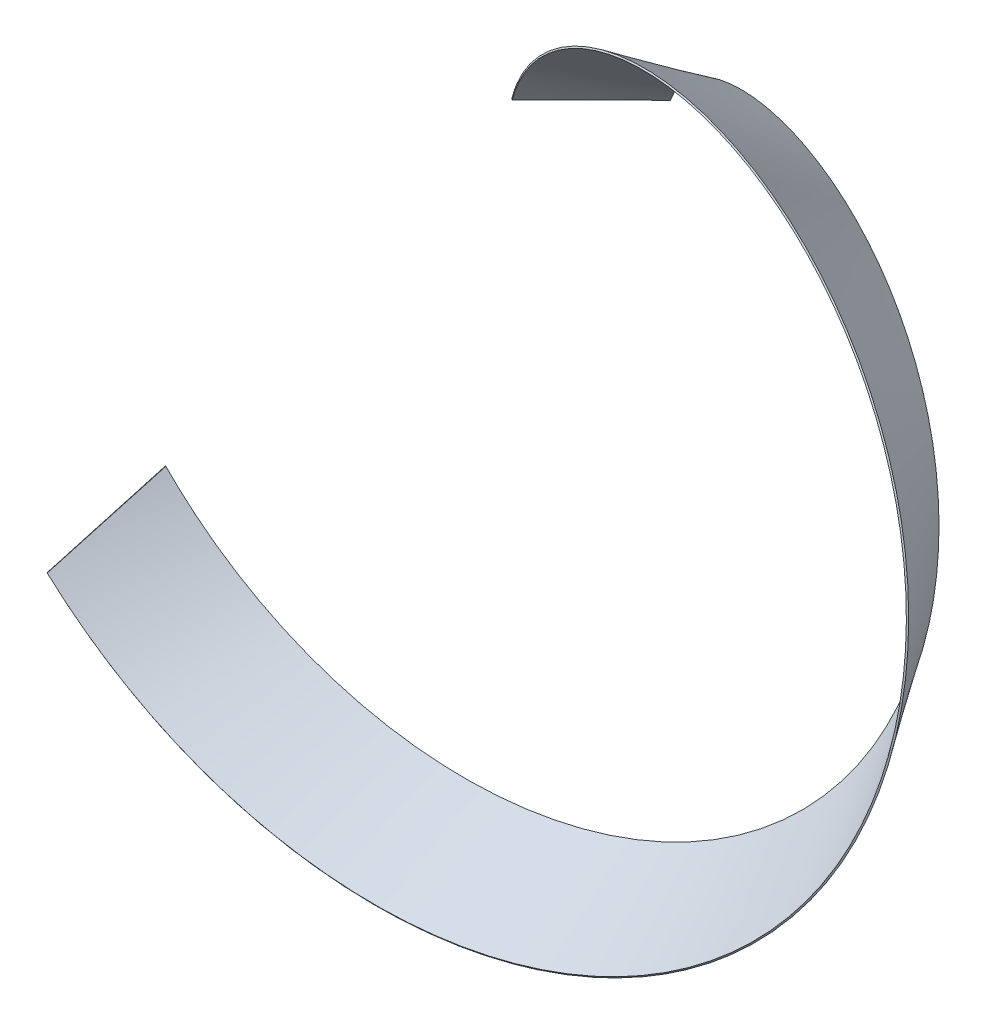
ISO-10303-21;
HEADER;
FILE_DESCRIPTION(('STEP AP214'),'2;1');
FILE_NAME('part.step','',(''),(''),'','','');
FILE_SCHEMA(('AUTOMOTIVE_DESIGN { 1 0 10303 214 1 1 1 1 }'));
ENDSEC;
DATA;
#1=APPLICATION_CONTEXT('core data for automotive mechanical design processes');
#2=APPLICATION_PROTOCOL_DEFINITION('international standard','automotive_design',2000,#1);
#3=PRODUCT_CONTEXT('',#1,'mechanical');
#4=PRODUCT('Part','Part','',(#3));
#5=PRODUCT_RELATED_PRODUCT_CATEGORY('part','',(#4));
#6=PRODUCT_DEFINITION_FORMATION('','',#4);
#7=PRODUCT_DEFINITION_CONTEXT('part definition',#1,'design');
#8=PRODUCT_DEFINITION('design','',#6,#7);
#9=PRODUCT_DEFINITION_SHAPE('','',#8);
#10=(LENGTH_UNIT() NAMED_UNIT(*) SI_UNIT(.MILLI.,.METRE.));
#11=(NAMED_UNIT(*) PLANE_ANGLE_UNIT() SI_UNIT($,.RADIAN.));
#12=(NAMED_UNIT(*) SI_UNIT($,.STERADIAN.) SOLID_ANGLE_UNIT());
#13=UNCERTAINTY_MEASURE_WITH_UNIT(LENGTH_MEASURE(1.E-05),#10,'distance_accuracy_value','');
#14=(GEOMETRIC_REPRESENTATION_CONTEXT(3) GLOBAL_UNCERTAINTY_ASSIGNED_CONTEXT((#13)) GLOBAL_UNIT_ASSIGNED_CONTEXT((#10,
#11,#12)) REPRESENTATION_CONTEXT('',''));
#15=CARTESIAN_POINT('',(0.,0.,0.));
#16=DIRECTION('',(0.,0.,1.));
#17=DIRECTION('',(1.,0.,0.));
#18=AXIS2_PLACEMENT_3D('',#15,#16,#17);
#19=CARTESIAN_POINT('',(-167.127931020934,113.616244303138,78.8459684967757));
#20=CARTESIAN_POINT('',(-158.200626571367,134.075598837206,83.8438034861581));
#21=CARTESIAN_POINT('',(-145.550514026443,153.604940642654,88.8440126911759));
#22=CARTESIAN_POINT('',(-113.573281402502,188.206283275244,98.8417798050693));
#23=CARTESIAN_POINT('',(-94.2408217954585,203.282993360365,103.841265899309));
#24=CARTESIAN_POINT('',(-50.5340541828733,226.723549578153,113.838924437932));
#25=CARTESIAN_POINT('',(-26.1558703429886,235.088638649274,118.838607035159));
#26=CARTESIAN_POINT('',(25.2619051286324,243.468121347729,128.836366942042));
#27=CARTESIAN_POINT('',(52.3020005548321,243.479079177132,133.836098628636));
#28=CARTESIAN_POINT('',(106.138701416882,234.363650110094,143.833984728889));
#29=CARTESIAN_POINT('',(132.93811016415,225.235336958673,148.833796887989));
#30=CARTESIAN_POINT('',(183.192139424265,198.067119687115,158.831764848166));
#31=CARTESIAN_POINT('',(206.644630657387,180.024501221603,163.831615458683));
#32=CARTESIAN_POINT('',(247.238280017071,136.310288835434,173.829687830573));
#33=CARTESIAN_POINT('',(264.380366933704,110.63572536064,178.829607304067));
#34=CARTESIAN_POINT('',(289.895923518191,53.9111546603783,188.827746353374));
#35=CARTESIAN_POINT('',(298.264664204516,22.8628846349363,193.827710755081));
#36=CARTESIAN_POINT('',(304.59176083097,-41.573888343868,203.825923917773));
#37=CARTESIAN_POINT('',(302.544894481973,-74.9577586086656,208.825930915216));
#38=CARTESIAN_POINT('',(287.454870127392,-140.545285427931,218.824211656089));
#39=CARTESIAN_POINT('',(274.408347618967,-172.742516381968,223.824257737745));
#40=CARTESIAN_POINT('',(237.92627225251,-232.321767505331,233.822600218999));
#41=CARTESIAN_POINT('',(214.490397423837,-259.695699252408,238.822454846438));
#42=CARTESIAN_POINT('',(172.897781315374,-294.637231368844,246.32159518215));
#43=CARTESIAN_POINT('',(157.969002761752,-305.268762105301,248.821419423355));
#44=CARTESIAN_POINT('',(126.311366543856,-324.14243982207,253.820861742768));
#45=CARTESIAN_POINT('',(109.581863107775,-332.385057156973,256.320693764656));
#46=CARTESIAN_POINT('',(74.7106452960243,-346.177425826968,261.320148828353));
#47=CARTESIAN_POINT('',(56.5682159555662,-351.727541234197,263.819987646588));
#48=CARTESIAN_POINT('',(19.3097406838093,-359.895303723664,268.819455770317));
#49=CARTESIAN_POINT('',(0.192932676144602,-362.513196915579,271.319301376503));
#50=CARTESIAN_POINT('',(-38.535474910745,-364.649072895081,276.318781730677));
#51=CARTESIAN_POINT('',(-58.147866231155,-364.167178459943,278.818633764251));
#52=CARTESIAN_POINT('',(-97.360408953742,-360.01490814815,283.818125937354));
#53=CARTESIAN_POINT('',(-116.961361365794,-356.344528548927,286.317984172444));
#54=CARTESIAN_POINT('',(-155.628858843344,-345.810234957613,291.317487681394));
#55=CARTESIAN_POINT('',(-174.696194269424,-338.946190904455,293.81735187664));
#56=CARTESIAN_POINT('',(-211.772987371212,-322.105513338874,298.816866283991));
#57=CARTESIAN_POINT('',(-229.783204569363,-312.128626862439,301.316736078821));
#58=CARTESIAN_POINT('',(-264.235262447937,-289.229314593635,306.316271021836));
#59=CARTESIAN_POINT('',(-280.677815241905,-276.306518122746,308.816157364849));
#60=CARTESIAN_POINT('',(-311.510724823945,-247.766984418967,313.815660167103));
#61=CARTESIAN_POINT('',(-325.901724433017,-232.149769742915,316.315496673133));
#62=CARTESIAN_POINT('',(-339.046244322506,-215.349924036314,318.815325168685));
#63=CARTESIAN_POINT('',(-168.147007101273,114.276109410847,77.9650246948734));
#64=CARTESIAN_POINT('',(-159.148275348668,134.847500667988,82.9641529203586));
#65=CARTESIAN_POINT('',(-146.410126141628,154.47430962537,87.9648826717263));
#66=CARTESIAN_POINT('',(-114.226186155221,189.242043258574,97.9651261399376));
#67=CARTESIAN_POINT('',(-94.7794008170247,204.382850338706,102.965024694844));
#68=CARTESIAN_POINT('',(-50.8240467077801,227.915084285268,112.965024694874));
#69=CARTESIAN_POINT('',(-26.3173649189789,236.30449458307,117.965024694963));
#70=CARTESIAN_POINT('',(25.3651012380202,244.691904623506,127.965024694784));
#71=CARTESIAN_POINT('',(52.5347341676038,244.685124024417,132.965024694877));
#72=CARTESIAN_POINT('',(106.624590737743,235.493384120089,142.965024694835));
#73=CARTESIAN_POINT('',(133.541081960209,226.307312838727,147.965024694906));
#74=CARTESIAN_POINT('',(184.011092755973,198.986657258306,157.965024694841));
#75=CARTESIAN_POINT('',(207.556404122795,180.85222238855,162.965024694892));
#76=CARTESIAN_POINT('',(248.306656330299,136.92540057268,172.965024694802));
#77=CARTESIAN_POINT('',(265.507795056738,111.13456090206,177.96502469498));
#78=CARTESIAN_POINT('',(291.104969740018,54.1588494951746,187.965024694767));
#79=CARTESIAN_POINT('',(299.493109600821,22.9816931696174,192.965024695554));
#80=CARTESIAN_POINT('',(305.818627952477,-41.7190447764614,202.965024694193));
#81=CARTESIAN_POINT('',(303.749640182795,-75.2313251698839,207.965024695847));
#82=CARTESIAN_POINT('',(288.575169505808,-141.0688667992,217.9650246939));
#83=CARTESIAN_POINT('',(275.467317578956,-173.38103311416,222.965024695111));
#84=CARTESIAN_POINT('',(238.826608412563,-233.171097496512,232.965024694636));
#85=CARTESIAN_POINT('',(215.295845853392,-260.63550828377,237.965024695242));
#86=CARTESIAN_POINT('',(173.541604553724,-295.688931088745,245.465024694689));
#87=CARTESIAN_POINT('',(158.556279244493,-306.353191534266,247.965024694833));
#88=CARTESIAN_POINT('',(126.780431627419,-325.283410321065,252.965024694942));
#89=CARTESIAN_POINT('',(109.989909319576,-333.549368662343,255.465024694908));
#90=CARTESIAN_POINT('',(74.9930113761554,-347.378810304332,260.465024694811));
#91=CARTESIAN_POINT('',(56.7866357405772,-352.942293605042,262.965024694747));
#92=CARTESIAN_POINT('',(19.398197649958,-361.126731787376,267.965024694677));
#93=CARTESIAN_POINT('',(0.21613519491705,-363.747686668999,270.46502469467));
#94=CARTESIAN_POINT('',(-38.6432322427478,-365.879430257,275.465024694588));
#95=CARTESIAN_POINT('',(-58.3205372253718,-365.390218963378,277.965024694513));
#96=CARTESIAN_POINT('',(-97.6617288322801,-361.213121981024,282.965024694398));
#97=CARTESIAN_POINT('',(-117.325615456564,-357.525236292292,285.465024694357));
#98=CARTESIAN_POINT('',(-156.116205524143,-346.946057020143,290.46502469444));
#99=CARTESIAN_POINT('',(-175.242908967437,-340.054763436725,292.965024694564));
#100=CARTESIAN_POINT('',(-212.434136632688,-323.150280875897,297.965024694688));
#101=CARTESIAN_POINT('',(-230.498660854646,-313.137091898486,300.46502469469));
#102=CARTESIAN_POINT('',(-265.053615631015,-290.15666964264,305.465035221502));
#103=CARTESIAN_POINT('',(-281.544046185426,-277.189436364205,307.965045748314));
#104=CARTESIAN_POINT('',(-312.465725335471,-248.55353690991,312.965012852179));
#105=CARTESIAN_POINT('',(-326.896973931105,-232.884870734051,315.464969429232));
#106=CARTESIAN_POINT('',(-340.077700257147,-216.030429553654,317.965024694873));
#107=B_SPLINE_SURFACE_WITH_KNOTS('',1,3,((#19,#20,#21,#22,#23,#24,#25,#26,#27,#28,#29,#30,#31,
#32,#33,#34,#35,#36,#37,#38,#39,#40,#41,#42,#43,#44,#45,#46,#47,#48,#49,#50,#51,#52,#53,#54,#55,
#56,#57,#58,#59,#60,#61,#62),(#63,#64,#65,#66,#67,#68,#69,#70,#71,#72,#73,#74,#75,#76,#77,#78,
#79,#80,#81,#82,#83,#84,#85,#86,#87,#88,#89,#90,#91,#92,#93,#94,#95,#96,#97,#98,#99,#100,#101,
#102,#103,#104,#105,#106)),.UNSPECIFIED.,.F.,.F.,.F.,(2,2),(4,2,2,2,2,2,2,2,2,2,2,2,2,2,2,2,2,2,
2,2,2,4),(0.,1.),(0.,0.0625,0.125,0.1875,0.25,0.3125,0.375,0.4375,0.5,0.5625,0.625,0.6875,
0.71875,0.75,0.78125,0.8125,0.84375,0.875,0.90625,0.9375,0.96875,1.),.UNSPECIFIED.);
#108=CARTESIAN_POINT('',(-340.077700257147,-216.030429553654,317.965024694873));
#109=CARTESIAN_POINT('',(-339.046244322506,-215.349924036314,318.815325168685));
#110=B_SPLINE_CURVE_WITH_KNOTS('',1,(#108,#109),.UNSPECIFIED.,.F.,.F.,(2,2),(0.,1.),.UNSPECIFIED.);
#111=CARTESIAN_POINT('',(-340.077700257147,-216.030429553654,317.965024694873));
#112=VERTEX_POINT('',#111);
#113=CARTESIAN_POINT('',(-339.046244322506,-215.349924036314,318.815325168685));
#114=VERTEX_POINT('',#113);
#115=EDGE_CURVE('E14',#112,#114,#110,.T.);
#116=CARTESIAN_POINT('',(-340.077700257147,-216.030429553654,317.965024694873));
#117=CARTESIAN_POINT('',(-326.896973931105,-232.884870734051,315.464969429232));
#118=CARTESIAN_POINT('',(-312.465725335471,-248.55353690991,312.965012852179));
#119=CARTESIAN_POINT('',(-281.544046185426,-277.189436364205,307.965045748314));
#120=CARTESIAN_POINT('',(-265.053615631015,-290.15666964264,305.465035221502));
#121=CARTESIAN_POINT('',(-230.498660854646,-313.137091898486,300.46502469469));
#122=CARTESIAN_POINT('',(-212.434136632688,-323.150280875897,297.965024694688));
#123=CARTESIAN_POINT('',(-175.242908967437,-340.054763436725,292.965024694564));
#124=CARTESIAN_POINT('',(-156.116205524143,-346.946057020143,290.46502469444));
#125=CARTESIAN_POINT('',(-117.325615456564,-357.525236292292,285.465024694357));
#126=CARTESIAN_POINT('',(-97.6617288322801,-361.213121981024,282.965024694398));
#127=CARTESIAN_POINT('',(-58.3205372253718,-365.390218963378,277.965024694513));
#128=CARTESIAN_POINT('',(-38.6432322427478,-365.879430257,275.465024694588));
#129=CARTESIAN_POINT('',(0.21613519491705,-363.747686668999,270.46502469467));
#130=CARTESIAN_POINT('',(19.398197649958,-361.126731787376,267.965024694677));
#131=CARTESIAN_POINT('',(56.7866357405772,-352.942293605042,262.965024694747));
#132=CARTESIAN_POINT('',(74.9930113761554,-347.378810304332,260.465024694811));
#133=CARTESIAN_POINT('',(109.989909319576,-333.549368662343,255.465024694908));
#134=CARTESIAN_POINT('',(126.780431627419,-325.283410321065,252.965024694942));
#135=CARTESIAN_POINT('',(158.556279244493,-306.353191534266,247.965024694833));
#136=CARTESIAN_POINT('',(173.541604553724,-295.688931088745,245.465024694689));
#137=CARTESIAN_POINT('',(215.295845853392,-260.63550828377,237.965024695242));
#138=CARTESIAN_POINT('',(238.826608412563,-233.171097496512,232.965024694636));
#139=CARTESIAN_POINT('',(275.467317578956,-173.38103311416,222.965024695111));
#140=CARTESIAN_POINT('',(288.575169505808,-141.0688667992,217.9650246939));
#141=CARTESIAN_POINT('',(303.749640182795,-75.2313251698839,207.965024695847));
#142=CARTESIAN_POINT('',(305.818627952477,-41.7190447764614,202.965024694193));
#143=CARTESIAN_POINT('',(299.493109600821,22.9816931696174,192.965024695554));
#144=CARTESIAN_POINT('',(291.104969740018,54.1588494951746,187.965024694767));
#145=CARTESIAN_POINT('',(265.507795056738,111.13456090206,177.96502469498));
#146=CARTESIAN_POINT('',(248.306656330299,136.92540057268,172.965024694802));
#147=CARTESIAN_POINT('',(207.556404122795,180.85222238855,162.965024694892));
#148=CARTESIAN_POINT('',(184.011092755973,198.986657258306,157.965024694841));
#149=CARTESIAN_POINT('',(133.541081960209,226.307312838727,147.965024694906));
#150=CARTESIAN_POINT('',(106.624590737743,235.493384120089,142.965024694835));
#151=CARTESIAN_POINT('',(52.5347341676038,244.685124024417,132.965024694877));
#152=CARTESIAN_POINT('',(25.3651012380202,244.691904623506,127.965024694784));
#153=CARTESIAN_POINT('',(-26.3173649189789,236.30449458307,117.965024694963));
#154=CARTESIAN_POINT('',(-50.8240467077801,227.915084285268,112.965024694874));
#155=CARTESIAN_POINT('',(-94.7794008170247,204.382850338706,102.965024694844));
#156=CARTESIAN_POINT('',(-114.226186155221,189.242043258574,97.9651261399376));
#157=CARTESIAN_POINT('',(-146.410126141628,154.47430962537,87.9648826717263));
#158=CARTESIAN_POINT('',(-159.148275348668,134.847500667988,82.9641529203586));
#159=CARTESIAN_POINT('',(-168.147007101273,114.276109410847,77.9650246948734));
#160=B_SPLINE_CURVE_WITH_KNOTS('',3,(#116,#117,#118,#119,#120,#121,#122,#123,#124,#125,#126,
#127,#128,#129,#130,#131,#132,#133,#134,#135,#136,#137,#138,#139,#140,#141,#142,#143,#144,#145,
#146,#147,#148,#149,#150,#151,#152,#153,#154,#155,#156,#157,#158,#159),.UNSPECIFIED.,.F.,.F.,(4,
2,2,2,2,2,2,2,2,2,2,2,2,2,2,2,2,2,2,2,2,4),(0.,0.03125,0.0625,0.09375,0.125,0.15625,0.1875,
0.21875,0.25,0.28125,0.3125,0.375,0.4375,0.5,0.5625,0.625,0.6875,0.75,0.8125,0.875,0.9375,1.),.UNSPECIFIED.);
#161=CARTESIAN_POINT('',(-168.147007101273,114.276109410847,77.9650246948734));
#162=VERTEX_POINT('',#161);
#163=EDGE_CURVE('E242',#112,#162,#160,.T.);
#164=CARTESIAN_POINT('',(-168.147007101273,114.276109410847,77.9650246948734));
#165=CARTESIAN_POINT('',(-167.127931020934,113.616244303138,78.8459684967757));
#166=B_SPLINE_CURVE_WITH_KNOTS('',1,(#164,#165),.UNSPECIFIED.,.F.,.F.,(2,2),(0.,1.),.UNSPECIFIED.);
#167=CARTESIAN_POINT('',(-167.127931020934,113.616244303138,78.8459684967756));
#168=VERTEX_POINT('',#167);
#169=EDGE_CURVE('E75',#162,#168,#166,.T.);
#170=CARTESIAN_POINT('',(-339.046244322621,-215.349924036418,318.815325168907));
#171=CARTESIAN_POINT('',(-335.766305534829,-219.541978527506,318.191540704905));
#172=CARTESIAN_POINT('',(-332.402557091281,-223.668307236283,317.566586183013));
#173=CARTESIAN_POINT('',(-325.525558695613,-231.767454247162,316.316670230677));
#174=CARTESIAN_POINT('',(-322.012917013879,-235.740790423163,315.691717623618));
#175=CARTESIAN_POINT('',(-314.84504836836,-243.528792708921,314.44181056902));
#176=CARTESIAN_POINT('',(-311.190406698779,-247.343998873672,313.816864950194));
#177=CARTESIAN_POINT('',(-303.745466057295,-254.81057567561,312.566975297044));
#178=CARTESIAN_POINT('',(-299.955732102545,-258.462511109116,311.942040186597));
#179=CARTESIAN_POINT('',(-292.247459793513,-265.597429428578,310.692153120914));
#180=CARTESIAN_POINT('',(-288.329464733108,-269.08100080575,310.067210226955));
#181=CARTESIAN_POINT('',(-280.372282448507,-275.875215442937,308.817307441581));
#182=CARTESIAN_POINT('',(-276.333610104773,-279.186463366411,308.192356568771));
#183=CARTESIAN_POINT('',(-268.142676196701,-285.632078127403,306.942446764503));
#184=CARTESIAN_POINT('',(-263.99090459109,-288.767069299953,306.317496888));
#185=CARTESIAN_POINT('',(-255.581373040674,-294.856215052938,305.067597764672));
#186=CARTESIAN_POINT('',(-251.324080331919,-297.811016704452,304.44265769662));
#187=CARTESIAN_POINT('',(-242.711020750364,-303.535868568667,303.19276327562));
#188=CARTESIAN_POINT('',(-238.355696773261,-306.306587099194,302.56781826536));
#189=CARTESIAN_POINT('',(-229.554617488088,-311.660621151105,301.317913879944));
#190=CARTESIAN_POINT('',(-225.109274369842,-314.244616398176,300.692963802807));
#191=CARTESIAN_POINT('',(-216.136179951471,-319.222579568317,299.443056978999));
#192=CARTESIAN_POINT('',(-211.608812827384,-321.617242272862,298.81810956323));
#193=CARTESIAN_POINT('',(-202.479691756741,-326.213913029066,297.568215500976));
#194=CARTESIAN_POINT('',(-197.878295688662,-328.416634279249,296.943278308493));
#195=CARTESIAN_POINT('',(-188.609047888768,-332.626820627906,295.693388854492));
#196=CARTESIAN_POINT('',(-183.941526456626,-334.635015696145,295.068446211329));
#197=CARTESIAN_POINT('',(-174.548277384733,-338.454855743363,293.818545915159));
#198=CARTESIAN_POINT('',(-169.822847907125,-340.267237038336,293.193597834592));
#199=CARTESIAN_POINT('',(-160.322010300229,-343.694178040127,291.943694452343));
#200=CARTESIAN_POINT('',(-155.546870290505,-345.309484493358,291.318748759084));
#201=CARTESIAN_POINT('',(-145.954837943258,-348.341001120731,290.068857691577));
#202=CARTESIAN_POINT('',(-141.138184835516,-349.757972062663,289.44392205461));
#203=CARTESIAN_POINT('',(-131.471259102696,-352.391554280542,288.194035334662));
#204=CARTESIAN_POINT('',(-126.621195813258,-353.608938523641,287.569094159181));
#205=CARTESIAN_POINT('',(-116.895682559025,-355.843408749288,286.319196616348));
#206=CARTESIAN_POINT('',(-112.02040918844,-356.86126884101,285.694250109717));
#207=CARTESIAN_POINT('',(-102.252683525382,-358.696770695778,284.444349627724));
#208=CARTESIAN_POINT('',(-97.3603764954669,-359.515192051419,283.819405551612));
#209=CARTESIAN_POINT('',(-87.5667906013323,-360.951893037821,282.569517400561));
#210=CARTESIAN_POINT('',(-82.6656262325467,-361.570961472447,281.944583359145));
#211=CARTESIAN_POINT('',(-72.8624384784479,-362.60902960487,280.694699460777));
#212=CARTESIAN_POINT('',(-67.9604981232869,-363.028825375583,280.069759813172));
#213=CARTESIAN_POINT('',(-58.1637563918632,-363.669726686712,278.819865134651));
#214=CARTESIAN_POINT('',(-53.2690055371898,-363.891624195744,278.194920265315));
#215=CARTESIAN_POINT('',(-43.4946133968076,-364.138121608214,276.945022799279));
#216=CARTESIAN_POINT('',(-38.6149908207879,-364.163513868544,276.320080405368));
#217=CARTESIAN_POINT('',(-28.8788257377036,-364.01839004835,275.070195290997));
#218=CARTESIAN_POINT('',(-24.0222700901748,-363.848670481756,274.445262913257));
#219=CARTESIAN_POINT('',(-14.3401167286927,-363.314693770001,273.195381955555));
#220=CARTESIAN_POINT('',(-9.51447364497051,-362.951235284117,272.57044390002));
#221=CARTESIAN_POINT('',(0.0982976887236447,-362.032403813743,271.320552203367));
#222=CARTESIAN_POINT('',(4.88550274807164,-361.477820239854,270.695609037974));
#223=CARTESIAN_POINT('',(14.413870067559,-360.179371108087,269.445714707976));
#224=CARTESIAN_POINT('',(19.1551406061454,-359.436290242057,268.820774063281));
#225=CARTESIAN_POINT('',(28.5841104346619,-357.763475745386,267.570892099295));
#226=CARTESIAN_POINT('',(33.2719501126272,-356.834525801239,266.94596144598));
#227=CARTESIAN_POINT('',(42.5866185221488,-354.792569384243,265.696083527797));
#228=CARTESIAN_POINT('',(47.2136198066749,-353.680343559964,265.071147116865));
#229=CARTESIAN_POINT('',(56.3996852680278,-351.275597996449,263.821258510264));
#230=CARTESIAN_POINT('',(60.9589515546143,-349.983844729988,263.196317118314));
#231=CARTESIAN_POINT('',(70.002650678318,-347.223811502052,261.946426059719));
#232=CARTESIAN_POINT('',(74.4873159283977,-345.756288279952,261.321487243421));
#233=CARTESIAN_POINT('',(83.3749156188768,-342.648479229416,260.071608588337));
#234=CARTESIAN_POINT('',(87.7781139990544,-341.008943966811,259.446679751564));
#235=CARTESIAN_POINT('',(96.4959648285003,-337.560828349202,258.196805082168));
#236=CARTESIAN_POINT('',(100.810912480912,-335.752990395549,257.571870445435));
#237=CARTESIAN_POINT('',(109.346133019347,-331.973041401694,256.321985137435));
#238=CARTESIAN_POINT('',(113.566728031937,-330.001654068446,255.697045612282));
#239=CARTESIAN_POINT('',(121.907143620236,-325.899377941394,254.447157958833));
#240=CARTESIAN_POINT('',(126.027314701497,-323.769198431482,253.822221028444));
#241=CARTESIAN_POINT('',(134.160781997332,-319.354107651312,252.572345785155));
#242=CARTESIAN_POINT('',(138.174458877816,-317.06989455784,251.9474188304));
#243=CARTESIAN_POINT('',(146.088909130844,-312.351443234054,250.697547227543));
#244=CARTESIAN_POINT('',(149.990092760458,-309.917890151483,250.072614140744));
#245=CARTESIAN_POINT('',(157.674377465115,-304.906387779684,248.822732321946));
#246=CARTESIAN_POINT('',(161.457912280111,-302.329100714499,248.197795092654));
#247=CARTESIAN_POINT('',(168.901709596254,-297.035705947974,246.947909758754));
#248=CARTESIAN_POINT('',(172.56243155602,-294.320241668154,246.322973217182));
#249=CARTESIAN_POINT('',(179.755561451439,-288.756243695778,245.073105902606));
#250=CARTESIAN_POINT('',(183.288456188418,-285.908336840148,244.44818681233));
#251=CARTESIAN_POINT('',(190.220168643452,-280.084666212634,243.198344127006));
#252=CARTESIAN_POINT('',(193.619509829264,-277.109523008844,242.573432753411));
#253=CARTESIAN_POINT('',(200.279885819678,-271.037524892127,241.323559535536));
#254=CARTESIAN_POINT('',(203.541462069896,-267.941261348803,240.698609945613));
#255=CARTESIAN_POINT('',(209.922904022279,-261.633699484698,239.448694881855));
#256=CARTESIAN_POINT('',(213.04332391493,-258.422959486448,238.823741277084));
#257=CARTESIAN_POINT('',(219.138878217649,-251.892936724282,237.57382282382));
#258=CARTESIAN_POINT('',(222.114584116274,-248.574185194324,236.948869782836));
#259=CARTESIAN_POINT('',(227.917177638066,-241.834677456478,235.698965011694));
#260=CARTESIAN_POINT('',(230.74465733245,-238.414428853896,235.07402514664));
#261=CARTESIAN_POINT('',(236.247243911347,-231.478446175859,233.824148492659));
#262=CARTESIAN_POINT('',(238.922966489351,-227.963198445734,233.199223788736));
#263=CARTESIAN_POINT('',(244.118490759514,-220.843746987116,231.949374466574));
#264=CARTESIAN_POINT('',(246.638933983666,-217.240009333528,231.324462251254));
#265=CARTESIAN_POINT('',(251.520331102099,-209.950085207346,230.074651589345));
#266=CARTESIAN_POINT('',(253.881953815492,-206.264344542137,229.449765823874));
#267=CARTESIAN_POINT('',(258.442233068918,-198.816977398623,228.199951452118));
#268=CARTESIAN_POINT('',(260.641584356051,-195.055774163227,227.575036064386));
#269=CARTESIAN_POINT('',(264.876052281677,-187.464848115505,226.325164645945));
#270=CARTESIAN_POINT('',(266.911868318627,-183.635513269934,225.700221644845));
#271=CARTESIAN_POINT('',(270.818053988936,-175.915407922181,224.45031651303));
#272=CARTESIAN_POINT('',(272.689125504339,-172.024990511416,223.825367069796));
#273=CARTESIAN_POINT('',(276.264626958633,-164.189823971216,222.575456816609));
#274=CARTESIAN_POINT('',(277.969766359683,-160.245396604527,221.950508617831));
#275=CARTESIAN_POINT('',(281.212199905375,-152.309306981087,220.700612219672));
#276=CARTESIAN_POINT('',(282.750215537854,-148.317937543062,220.075676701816));
#277=CARTESIAN_POINT('',(285.657188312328,-140.29505977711,218.825807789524));
#278=CARTESIAN_POINT('',(287.026882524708,-136.263816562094,218.200887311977));
#279=CARTESIAN_POINT('',(289.59600419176,-128.168292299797,216.951045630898));
#280=CARTESIAN_POINT('',(290.79618676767,-124.104248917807,216.326137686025));
#281=CARTESIAN_POINT('',(293.025051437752,-115.950211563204,215.076334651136));
#282=CARTESIAN_POINT('',(294.05450815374,-111.860427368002,214.451453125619));
#283=CARTESIAN_POINT('',(295.940793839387,-103.662012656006,213.201646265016));
#284=CARTESIAN_POINT('',(296.798414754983,-99.5535622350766,212.576735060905));
#285=CARTESIAN_POINT('',(298.342181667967,-91.3249652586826,211.326871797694));
#286=CARTESIAN_POINT('',(299.029112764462,-87.2049638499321,210.701933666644));
#287=CARTESIAN_POINT('',(300.232614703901,-78.9601355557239,209.452037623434));
#288=CARTESIAN_POINT('',(300.749961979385,-74.8354199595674,208.827093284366));
#289=CARTESIAN_POINT('',(301.615433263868,-66.5880476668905,207.577192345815));
#290=CARTESIAN_POINT('',(301.964330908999,-62.4654701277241,206.952249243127));
#291=CARTESIAN_POINT('',(302.494029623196,-54.2292544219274,205.702361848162));
#292=CARTESIAN_POINT('',(302.67560646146,-50.1156641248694,205.077431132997));
#293=CARTESIAN_POINT('',(302.871781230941,-41.9043057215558,203.827570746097));
#294=CARTESIAN_POINT('',(302.8871608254,-37.8065542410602,203.202654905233));
#295=CARTESIAN_POINT('',(302.752065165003,-29.6337595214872,201.952821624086));
#296=CARTESIAN_POINT('',(302.602379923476,-25.5587011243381,201.327918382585));
#297=CARTESIAN_POINT('',(302.138249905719,-17.4381738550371,200.078123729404));
#298=CARTESIAN_POINT('',(301.824604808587,-13.3926571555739,199.453246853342));
#299=CARTESIAN_POINT('',(301.033756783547,-5.33806989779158,198.203448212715));
#300=CARTESIAN_POINT('',(300.557360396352,-1.32891784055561,197.57854158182));
#301=CARTESIAN_POINT('',(299.444318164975,6.6467572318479,196.328687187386));
#302=CARTESIAN_POINT('',(298.808461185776,10.6133927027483,195.703754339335));
#303=CARTESIAN_POINT('',(297.379680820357,18.4980980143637,194.453868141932));
#304=CARTESIAN_POINT('',(296.587527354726,22.4163096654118,193.828929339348));
#305=CARTESIAN_POINT('',(294.84936281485,30.198224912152,192.579038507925));
#306=CARTESIAN_POINT('',(293.904108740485,34.0620998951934,191.954100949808));
#307=CARTESIAN_POINT('',(291.86294085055,41.7293996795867,190.704223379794));
#308=CARTESIAN_POINT('',(290.767776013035,45.5330262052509,190.079297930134));
#309=CARTESIAN_POINT('',(288.429976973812,53.0738818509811,188.829446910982));
#310=CARTESIAN_POINT('',(287.18808730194,56.8113441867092,188.204536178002));
#311=CARTESIAN_POINT('',(284.560036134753,64.2139232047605,186.954712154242));
#312=CARTESIAN_POINT('',(283.17461690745,67.8793058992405,186.32981409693));
#313=CARTESIAN_POINT('',(280.262675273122,75.1317724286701,185.080028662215));
#314=CARTESIAN_POINT('',(278.736893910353,78.7191563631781,184.455156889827));
#315=CARTESIAN_POINT('',(275.547487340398,85.8097364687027,183.205367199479));
#316=CARTESIAN_POINT('',(273.884598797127,89.3132668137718,182.580465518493));
#317=CARTESIAN_POINT('',(270.425952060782,96.2315323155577,181.330620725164));
#318=CARTESIAN_POINT('',(268.630903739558,99.646625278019,180.70569360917));
#319=CARTESIAN_POINT('',(264.912715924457,106.383596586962,179.455818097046));
#320=CARTESIAN_POINT('',(262.990258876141,109.705854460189,178.830885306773));
#321=CARTESIAN_POINT('',(259.022058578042,116.25273915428,177.58100542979));
#322=CARTESIAN_POINT('',(256.976975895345,119.477769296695,176.956073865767));
#323=CARTESIAN_POINT('',(252.768321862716,125.825773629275,175.706207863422));
#324=CARTESIAN_POINT('',(250.605393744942,128.949177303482,175.081289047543));
#325=CARTESIAN_POINT('',(246.16588406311,135.089489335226,173.831448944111));
#326=CARTESIAN_POINT('',(243.889932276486,138.106856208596,173.206543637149));
#327=CARTESIAN_POINT('',(239.22921426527,144.030642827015,171.95673141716));
#328=CARTESIAN_POINT('',(236.845066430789,146.937552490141,171.33184097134));
#329=CARTESIAN_POINT('',(231.9727968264,152.635980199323,170.082061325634));
#330=CARTESIAN_POINT('',(229.485282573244,155.428021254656,169.457189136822));
#331=CARTESIAN_POINT('',(224.410980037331,160.892390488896,168.207402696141));
#332=CARTESIAN_POINT('',(221.824781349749,163.565270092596,167.582505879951));
#333=CARTESIAN_POINT('',(216.558974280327,168.788741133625,166.332675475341));
#334=CARTESIAN_POINT('',(213.879918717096,171.339893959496,165.707758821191));
#335=CARTESIAN_POINT('',(208.434244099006,176.317382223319,164.457900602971));
#336=CARTESIAN_POINT('',(205.66814650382,178.744292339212,163.832975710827));
#337=CARTESIAN_POINT('',(200.054231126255,183.470753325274,162.583110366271));
#338=CARTESIAN_POINT('',(197.206908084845,185.770896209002,161.958186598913));
#339=CARTESIAN_POINT('',(191.436375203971,190.241286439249,160.70833168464));
#340=CARTESIAN_POINT('',(188.513636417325,192.412146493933,160.083417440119));
#341=CARTESIAN_POINT('',(182.598051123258,196.621440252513,158.83358648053));
#342=CARTESIAN_POINT('',(179.60565298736,198.660509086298,158.208686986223));
#343=CARTESIAN_POINT('',(173.55652576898,202.603703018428,156.958883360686));
#344=CARTESIAN_POINT('',(170.500223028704,204.508487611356,156.333996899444));
#345=CARTESIAN_POINT('',(164.329043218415,208.180573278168,155.084232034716));
#346=CARTESIAN_POINT('',(161.214570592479,209.948559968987,154.45937173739));
#347=CARTESIAN_POINT('',(154.932831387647,213.344623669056,153.209602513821));
#348=CARTESIAN_POINT('',(151.765944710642,214.97341020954,152.584712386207));
#349=CARTESIAN_POINT('',(145.385688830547,218.090582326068,151.33488973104));
#350=CARTESIAN_POINT('',(142.17266377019,219.579679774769,150.709975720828));
#351=CARTESIAN_POINT('',(135.70618479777,222.417004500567,149.460124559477));
#352=CARTESIAN_POINT('',(132.453040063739,223.765944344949,148.835205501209));
#353=CARTESIAN_POINT('',(125.912394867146,226.322503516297,147.585350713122));
#354=CARTESIAN_POINT('',(122.625171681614,227.530840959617,146.960432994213));
#355=CARTESIAN_POINT('',(116.022441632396,229.805733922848,145.710591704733));
#356=CARTESIAN_POINT('',(112.707182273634,230.873017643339,145.085686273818));
#357=CARTESIAN_POINT('',(106.054489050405,232.86535376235,143.835870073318));
#358=CARTESIAN_POINT('',(102.717274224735,233.791148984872,143.210977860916));
#359=CARTESIAN_POINT('',(96.0267895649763,235.500051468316,141.961189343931));
#360=CARTESIAN_POINT('',(92.6737105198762,236.283919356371,141.336312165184));
#361=CARTESIAN_POINT('',(85.9576141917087,237.70851645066,140.086555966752));
#362=CARTESIAN_POINT('',(82.5947588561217,238.350025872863,139.461696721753));
#363=CARTESIAN_POINT('',(75.8650394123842,239.489470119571,138.21193297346));
#364=CARTESIAN_POINT('',(72.4983056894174,239.98819690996,137.587048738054));
#365=CARTESIAN_POINT('',(65.7665981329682,240.843602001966,136.337242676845));
#366=CARTESIAN_POINT('',(62.401719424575,241.201057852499,135.712340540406));
#367=CARTESIAN_POINT('',(55.6794516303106,241.775469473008,134.462509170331));
#368=CARTESIAN_POINT('',(52.3221246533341,241.993194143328,133.83759934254));
#369=CARTESIAN_POINT('',(45.6206953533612,242.289680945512,132.587761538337));
#370=CARTESIAN_POINT('',(42.2766233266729,242.369209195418,131.962852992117));
#371=CARTESIAN_POINT('',(35.6074289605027,242.390839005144,130.713025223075));
#372=CARTESIAN_POINT('',(32.2823054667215,242.333708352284,130.088125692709));
#373=CARTESIAN_POINT('',(25.656689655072,242.083527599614,128.838321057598));
#374=CARTESIAN_POINT('',(22.3561644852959,241.891249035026,128.213436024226));
#375=CARTESIAN_POINT('',(15.7854174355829,241.372289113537,126.963658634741));
#376=CARTESIAN_POINT('',(12.5151303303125,241.046385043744,126.338786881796));
#377=CARTESIAN_POINT('',(6.01052985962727,240.261660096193,125.089048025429));
#378=CARTESIAN_POINT('',(2.77611790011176,239.803623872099,124.46420206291));
#379=CARTESIAN_POINT('',(-3.65112572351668,238.756225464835,123.214458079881));
#380=CARTESIAN_POINT('',(-6.84409005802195,238.167651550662,122.589581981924));
#381=CARTESIAN_POINT('',(-13.1835664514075,236.86249576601,121.339785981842));
#382=CARTESIAN_POINT('',(-16.3302409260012,236.146682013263,120.714887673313));
#383=CARTESIAN_POINT('',(-22.5724708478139,234.590225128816,119.465065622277));
#384=CARTESIAN_POINT('',(-25.6682168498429,233.750329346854,118.840163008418));
#385=CARTESIAN_POINT('',(-31.8039191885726,231.948914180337,117.590338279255));
#386=CARTESIAN_POINT('',(-34.8440947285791,230.988126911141,116.965437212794));
#387=CARTESIAN_POINT('',(-40.8639799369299,228.948125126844,115.715625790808));
#388=CARTESIAN_POINT('',(-43.8439385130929,227.869632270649,115.090736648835));
#389=CARTESIAN_POINT('',(-49.7386930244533,225.597447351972,113.84094963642));
#390=CARTESIAN_POINT('',(-52.6537692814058,224.404470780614,113.216073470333));
#391=CARTESIAN_POINT('',(-58.4140501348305,221.906547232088,111.966314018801));
#392=CARTESIAN_POINT('',(-61.2595682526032,220.602312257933,111.341453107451));
#393=CARTESIAN_POINT('',(-66.876028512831,217.885103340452,110.091725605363));
#394=CARTESIAN_POINT('',(-69.6473189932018,216.472839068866,109.466882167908));
#395=CARTESIAN_POINT('',(-75.1107791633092,213.542702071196,108.217146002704));
#396=CARTESIAN_POINT('',(-77.803329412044,212.025528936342,107.592277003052));
#397=CARTESIAN_POINT('',(-83.1060321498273,208.890040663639,106.342500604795));
#398=CARTESIAN_POINT('',(-85.7165842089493,207.272392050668,105.717616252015));
#399=CARTESIAN_POINT('',(-90.8520527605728,203.940412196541,104.467818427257));
#400=CARTESIAN_POINT('',(-93.3773895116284,202.226720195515,103.842927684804));
#401=CARTESIAN_POINT('',(-98.3391796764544,198.707108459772,102.593125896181));
#402=CARTESIAN_POINT('',(-100.776076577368,196.901805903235,101.968237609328));
#403=CARTESIAN_POINT('',(-105.557742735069,193.203422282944,100.718448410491));
#404=CARTESIAN_POINT('',(-107.902981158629,191.310940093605,100.093570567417));
#405=CARTESIAN_POINT('',(-112.498102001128,187.44262810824,98.8438029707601));
#406=CARTESIAN_POINT('',(-114.748481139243,185.46738084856,98.2189368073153));
#407=CARTESIAN_POINT('',(-119.150656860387,181.437967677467,96.9691913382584));
#408=CARTESIAN_POINT('',(-121.302979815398,179.384369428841,96.3443363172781));
#409=CARTESIAN_POINT('',(-125.505821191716,175.202683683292,95.0946111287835));
#410=CARTESIAN_POINT('',(-127.556897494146,173.075149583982,94.4697660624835));
#411=CARTESIAN_POINT('',(-131.554139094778,168.749880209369,93.2200155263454));
#412=CARTESIAN_POINT('',(-133.500888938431,166.552677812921,92.5951357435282));
#413=CARTESIAN_POINT('',(-137.287949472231,162.093198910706,91.3453311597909));
#414=CARTESIAN_POINT('',(-139.128852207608,159.831418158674,90.7204313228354));
#415=CARTESIAN_POINT('',(-142.702715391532,155.247896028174,89.4705996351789));
#416=CARTESIAN_POINT('',(-144.436279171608,152.926618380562,88.8456924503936));
#417=CARTESIAN_POINT('',(-147.793950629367,148.229215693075,87.5958592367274));
#418=CARTESIAN_POINT('',(-149.418677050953,145.853526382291,86.9709579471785));
#419=CARTESIAN_POINT('',(-152.557161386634,141.052407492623,85.7211485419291));
#420=CARTESIAN_POINT('',(-154.071557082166,138.627388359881,85.0962655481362));
#421=CARTESIAN_POINT('',(-156.987859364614,133.73268552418,83.8465057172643));
#422=CARTESIAN_POINT('',(-158.390425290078,131.263388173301,83.2216545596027));
#423=CARTESIAN_POINT('',(-161.081562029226,126.285189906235,81.9719694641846));
#424=CARTESIAN_POINT('',(-162.370816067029,123.776651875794,81.3471619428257));
#425=CARTESIAN_POINT('',(-164.833781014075,118.725074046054,80.0975725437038));
#426=CARTESIAN_POINT('',(-166.008201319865,116.182373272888,79.4728179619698));
#427=CARTESIAN_POINT('',(-167.127931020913,113.616244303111,78.8459684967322));
#428=B_SPLINE_CURVE_WITH_KNOTS('',3,(#170,#171,#172,#173,#174,#175,#176,#177,#178,#179,#180,
#181,#182,#183,#184,#185,#186,#187,#188,#189,#190,#191,#192,#193,#194,#195,#196,#197,#198,#199,
#200,#201,#202,#203,#204,#205,#206,#207,#208,#209,#210,#211,#212,#213,#214,#215,#216,#217,#218,
#219,#220,#221,#222,#223,#224,#225,#226,#227,#228,#229,#230,#231,#232,#233,#234,#235,#236,#237,
#238,#239,#240,#241,#242,#243,#244,#245,#246,#247,#248,#249,#250,#251,#252,#253,#254,#255,#256,
#257,#258,#259,#260,#261,#262,#263,#264,#265,#266,#267,#268,#269,#270,#271,#272,#273,#274,#275,
#276,#277,#278,#279,#280,#281,#282,#283,#284,#285,#286,#287,#288,#289,#290,#291,#292,#293,#294,
#295,#296,#297,#298,#299,#300,#301,#302,#303,#304,#305,#306,#307,#308,#309,#310,#311,#312,#313,
#314,#315,#316,#317,#318,#319,#320,#321,#322,#323,#324,#325,#326,#327,#328,#329,#330,#331,#332,
#333,#334,#335,#336,#337,#338,#339,#340,#341,#342,#343,#344,#345,#346,#347,#348,#349,#350,#351,
#352,#353,#354,#355,#356,#357,#358,#359,#360,#361,#362,#363,#364,#365,#366,#367,#368,#369,#370,
#371,#372,#373,#374,#375,#376,#377,#378,#379,#380,#381,#382,#383,#384,#385,#386,#387,#388,#389,
#390,#391,#392,#393,#394,#395,#396,#397,#398,#399,#400,#401,#402,#403,#404,#405,#406,#407,#408,
#409,#410,#411,#412,#413,#414,#415,#416,#417,#418,#419,#420,#421,#422,#423,#424,#425,#426,#427),
.UNSPECIFIED.,.F.,.F.,(4,2,2,2,2,2,2,2,2,2,2,2,2,2,2,2,2,2,2,2,2,2,2,2,2,2,2,2,2,2,2,2,2,2,2,2,
2,2,2,2,2,2,2,2,2,2,2,2,2,2,2,2,2,2,2,2,2,2,2,2,2,2,2,2,2,2,2,2,2,2,2,2,2,2,2,2,2,2,2,2,2,2,2,2,
2,2,2,2,2,2,2,2,2,2,2,2,2,2,2,2,2,2,2,2,2,2,2,2,2,2,2,2,2,2,2,2,2,2,2,2,2,2,2,2,2,2,2,2,4),(0.,
16.0764007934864,32.0924840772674,48.0483930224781,63.9439873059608,79.7792677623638,
95.554607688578,111.270001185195,126.925159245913,142.519965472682,158.054798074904,
173.529686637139,188.94437715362,204.298779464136,219.593272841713,234.827883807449,
250.002355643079,265.116595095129,280.170980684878,295.165540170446,310.100018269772,
324.974321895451,339.788829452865,354.543570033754,369.238289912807,383.872896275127,
398.447767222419,412.962932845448,427.418140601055,441.813297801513,456.148783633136,
470.424631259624,484.640591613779,498.796573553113,512.892952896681,526.929759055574,
540.906739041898,554.823798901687,568.681324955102,582.479363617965,596.217680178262,
609.895291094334,623.512883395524,637.071303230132,650.570911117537,664.011683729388,
677.39331766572,690.715335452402,703.977194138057,717.178510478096,730.319974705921,
743.402427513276,756.42623068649,769.391365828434,782.297535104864,795.144264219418,
807.931007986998,820.657392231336,833.32410950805,845.931995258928,858.481412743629,
870.972348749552,883.404511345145,895.777429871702,908.09055753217,920.343529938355,
932.537042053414,944.671924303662,956.748541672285,968.766886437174,980.726672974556,
992.627434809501,1004.46862426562,1016.24988891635,1027.97193594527,1039.63560448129,
1051.24127606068,1062.78894753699,1074.27824639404,1085.70858115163,1097.07926653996,
1108.39026993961,1119.64272351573,1130.83728046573,1141.97413281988,1153.0531316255,
1164.07399338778,1175.03629184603,1185.93951113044,1196.78334970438,1207.56852532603,
1218.29586785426,1228.96576316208,1239.57822224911,1250.13289509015,1260.62921060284,
1271.06649505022,1281.44471328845,1291.76498708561,1302.02797312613,1312.23388065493,
1322.3825833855,1332.47381466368,1342.50716068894,1352.48210980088,1362.39838899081,
1372.25672199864,1382.05793151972,1391.80241009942,1401.49018572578,1411.12093424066,
1420.69410929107,1430.20905439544,1439.66573923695,1449.06528367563,1458.40835725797,
1467.69519693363,1476.92570421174,1486.09958500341,1495.21637149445,1504.27548545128,
1513.27695164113,1522.22184645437,1531.1107722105,1539.94390302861,1548.72107597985,
1557.4419394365,1566.1059793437,1574.71257515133),.UNSPECIFIED.);
#429=EDGE_CURVE('E128',#114,#168,#428,.T.);
#430=ORIENTED_EDGE('',*,*,#115,.F.);
#431=ORIENTED_EDGE('',*,*,#163,.T.);
#432=ORIENTED_EDGE('',*,*,#169,.T.);
#433=ORIENTED_EDGE('',*,*,#429,.F.);
#434=EDGE_LOOP('',(#430,#431,#432,#433));
#435=FACE_BOUND('',#434,.T.);
#436=ADVANCED_FACE('F61',(#435),#107,.F.);
#437=CARTESIAN_POINT('',(-167.127931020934,113.616244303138,78.8459684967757));
#438=CARTESIAN_POINT('',(-146.453618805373,110.835311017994,52.8468776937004));
#439=CARTESIAN_POINT('',(-125.784977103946,108.044163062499,26.8443423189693));
#440=CARTESIAN_POINT('',(-105.134610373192,105.232614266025,0.829410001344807));
#441=CARTESIAN_POINT('',(-168.147007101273,114.276109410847,77.9650246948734));
#442=CARTESIAN_POINT('',(-147.453343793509,111.539411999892,51.9766831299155));
#443=CARTESIAN_POINT('',(-126.759680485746,108.802714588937,25.9883415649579));
#444=CARTESIAN_POINT('',(-106.066017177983,106.066017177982,0.));
#445=B_SPLINE_SURFACE_WITH_KNOTS('',1,3,((#437,#438,#439,#440),(#441,#442,#443,#444)),
.UNSPECIFIED.,.F.,.F.,.F.,(2,2),(4,4),(0.,1.),(-0.05,0.05),.UNSPECIFIED.);
#446=CARTESIAN_POINT('',(-168.147007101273,114.276109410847,77.9650246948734));
#447=CARTESIAN_POINT('',(-147.453343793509,111.539411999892,51.9766831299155));
#448=CARTESIAN_POINT('',(-126.759680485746,108.802714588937,25.9883415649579));
#449=CARTESIAN_POINT('',(-106.066017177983,106.066017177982,0.));
#450=B_SPLINE_CURVE_WITH_KNOTS('',3,(#446,#447,#448,#449),.UNSPECIFIED.,.F.,.F.,(4,4),(-0.05,
0.05),.UNSPECIFIED.);
#451=CARTESIAN_POINT('',(-106.066017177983,106.066017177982,0.));
#452=VERTEX_POINT('',#451);
#453=EDGE_CURVE('E111',#162,#452,#450,.T.);
#454=CARTESIAN_POINT('',(-106.066017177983,106.066017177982,0.));
#455=CARTESIAN_POINT('',(-105.134610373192,105.232614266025,0.829410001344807));
#456=B_SPLINE_CURVE_WITH_KNOTS('',1,(#454,#455),.UNSPECIFIED.,.F.,.F.,(2,2),(0.,1.),.UNSPECIFIED.);
#457=CARTESIAN_POINT('',(-105.134610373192,105.232614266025,0.829410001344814));
#458=VERTEX_POINT('',#457);
#459=EDGE_CURVE('E105',#452,#458,#456,.T.);
#460=CARTESIAN_POINT('',(-167.127931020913,113.616244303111,78.8459684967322));
#461=CARTESIAN_POINT('',(-164.543642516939,113.268627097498,75.5960812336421));
#462=CARTESIAN_POINT('',(-161.95945943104,112.920843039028,72.3461279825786));
#463=CARTESIAN_POINT('',(-156.791334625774,112.224909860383,65.846067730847));
#464=CARTESIAN_POINT('',(-154.207392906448,111.876760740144,62.5959607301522));
#465=CARTESIAN_POINT('',(-149.039781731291,111.180066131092,56.0955716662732));
#466=CARTESIAN_POINT('',(-146.456112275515,110.831520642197,52.845289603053));
#467=CARTESIAN_POINT('',(-141.289082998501,110.133998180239,46.3445243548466));
#468=CARTESIAN_POINT('',(-138.705723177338,109.785021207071,43.0940411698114));
#469=CARTESIAN_POINT('',(-133.539356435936,109.086597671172,36.5928432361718));
#470=CARTESIAN_POINT('',(-130.956349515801,108.737151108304,33.3421284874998));
#471=CARTESIAN_POINT('',(-125.790739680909,108.037746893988,26.8404311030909));
#472=CARTESIAN_POINT('',(-123.208136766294,107.68778924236,23.5894484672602));
#473=CARTESIAN_POINT('',(-118.04339407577,106.987318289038,17.0871729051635));
#474=CARTESIAN_POINT('',(-115.461254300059,106.636804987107,13.8358799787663));
#475=CARTESIAN_POINT('',(-110.297511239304,105.935174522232,7.3329305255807));
#476=CARTESIAN_POINT('',(-107.715907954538,105.584057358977,4.08127399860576));
#477=CARTESIAN_POINT('',(-105.134610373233,105.232614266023,0.829410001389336));
#478=B_SPLINE_CURVE_WITH_KNOTS('',3,(#460,#461,#462,#463,#464,#465,#466,#467,#468,#469,#470,
#471,#472,#473,#474,#475,#476,#477),.UNSPECIFIED.,.F.,.F.,(4,2,2,2,2,2,2,2,4),(0.,
12.5000147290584,25.0000316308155,37.5000511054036,50.0000736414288,62.5000998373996,
75.0001304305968,87.5001663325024,100.000208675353),.UNSPECIFIED.);
#479=EDGE_CURVE('E109',#168,#458,#478,.T.);
#480=ORIENTED_EDGE('',*,*,#169,.F.);
#481=ORIENTED_EDGE('',*,*,#453,.T.);
#482=ORIENTED_EDGE('',*,*,#459,.T.);
#483=ORIENTED_EDGE('',*,*,#479,.F.);
#484=EDGE_LOOP('',(#480,#481,#482,#483));
#485=FACE_BOUND('',#484,.T.);
#486=ADVANCED_FACE('F108',(#485),#445,.T.);
#487=CARTESIAN_POINT('',(-105.134610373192,105.232614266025,0.829410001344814));
#488=CARTESIAN_POINT('',(-101.108460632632,112.219940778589,3.32910857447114));
#489=CARTESIAN_POINT('',(-96.414964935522,119.007897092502,5.82886916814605));
#490=CARTESIAN_POINT('',(-85.7426730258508,131.938345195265,10.8283088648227));
#491=CARTESIAN_POINT('',(-79.7633991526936,138.081414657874,13.3282071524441));
#492=CARTESIAN_POINT('',(-66.6126125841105,149.482605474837,18.3276579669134));
#493=CARTESIAN_POINT('',(-59.4405460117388,154.741226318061,20.8274549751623));
#494=CARTESIAN_POINT('',(-44.041412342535,164.148713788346,25.8269536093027));
#495=CARTESIAN_POINT('',(-35.8136957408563,168.297992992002,28.3268822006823));
#496=CARTESIAN_POINT('',(-18.4815819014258,175.284017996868,33.3263835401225));
#497=CARTESIAN_POINT('',(-9.37650098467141,178.121067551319,35.8262036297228));
#498=CARTESIAN_POINT('',(9.49409618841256,182.309946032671,40.8257470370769));
#499=CARTESIAN_POINT('',(19.2603714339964,183.661966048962,43.3257017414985));
#500=CARTESIAN_POINT('',(39.2049921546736,184.744434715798,48.325256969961));
#501=CARTESIAN_POINT('',(49.3839876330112,184.474858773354,50.8250933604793));
#502=CARTESIAN_POINT('',(69.8791455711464,182.220443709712,55.8246794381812));
#503=CARTESIAN_POINT('',(80.1960795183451,180.235553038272,58.3246598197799));
#504=CARTESIAN_POINT('',(100.673545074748,174.503700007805,63.3242423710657));
#505=CARTESIAN_POINT('',(110.834812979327,170.756577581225,65.8240961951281));
#506=CARTESIAN_POINT('',(130.696743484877,161.504687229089,70.8237145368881));
#507=CARTESIAN_POINT('',(140.398135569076,155.999623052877,73.3237138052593));
#508=CARTESIAN_POINT('',(159.034474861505,143.2886404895,78.3233381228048));
#509=CARTESIAN_POINT('',(167.969924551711,136.082326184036,80.8232021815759));
#510=CARTESIAN_POINT('',(184.775761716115,120.079407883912,85.8228518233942));
#511=CARTESIAN_POINT('',(192.646745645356,111.282302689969,88.3228717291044));
#512=CARTESIAN_POINT('',(207.041598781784,92.2602426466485,93.3225129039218));
#513=CARTESIAN_POINT('',(213.565970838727,82.0347206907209,95.8223894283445));
#514=CARTESIAN_POINT('',(225.011652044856,60.3683017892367,100.822062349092));
#515=CARTESIAN_POINT('',(229.933377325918,48.9267312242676,103.322096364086));
#516=CARTESIAN_POINT('',(237.952095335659,25.0855650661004,108.321771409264));
#517=CARTESIAN_POINT('',(241.049258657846,12.6853645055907,110.8216542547));
#518=CARTESIAN_POINT('',(245.239691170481,-12.775583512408,115.821346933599));
#519=CARTESIAN_POINT('',(246.333147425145,-25.8371005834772,118.321395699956));
#520=CARTESIAN_POINT('',(246.38612006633,-52.2911909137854,123.321091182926));
#521=CARTESIAN_POINT('',(245.345611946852,-65.6843868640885,125.820980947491));
#522=CARTESIAN_POINT('',(241.055998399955,-92.4477173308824,130.820692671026));
#523=CARTESIAN_POINT('',(237.806831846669,-105.818643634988,133.320754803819));
#524=CARTESIAN_POINT('',(229.084253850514,-132.168847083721,138.320468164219));
#525=CARTESIAN_POINT('',(223.610628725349,-145.148703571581,140.820363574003));
#526=CARTESIAN_POINT('',(210.486075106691,-170.34302811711,145.820092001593));
#527=CARTESIAN_POINT('',(202.834842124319,-182.558231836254,148.320166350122));
#528=CARTESIAN_POINT('',(185.464648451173,-205.855487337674,153.319895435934));
#529=CARTESIAN_POINT('',(175.745309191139,-216.938019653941,155.819795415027));
#530=CARTESIAN_POINT('',(154.411428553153,-237.618419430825,160.819538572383));
#531=CARTESIAN_POINT('',(142.796368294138,-247.216893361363,163.319624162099));
#532=CARTESIAN_POINT('',(117.902769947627,-264.604761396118,168.31936715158));
#533=CARTESIAN_POINT('',(104.623772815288,-272.39454176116,170.819366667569));
#534=CARTESIAN_POINT('',(76.6899151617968,-285.877740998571,175.819118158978));
#535=CARTESIAN_POINT('',(62.0343934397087,-291.571570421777,178.319121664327));
#536=CARTESIAN_POINT('',(31.684303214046,-300.622149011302,183.318878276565));
#537=CARTESIAN_POINT('',(15.9890128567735,-303.979201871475,185.818884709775));
#538=CARTESIAN_POINT('',(-16.0622514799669,-308.170615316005,190.81864729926));
#539=CARTESIAN_POINT('',(-32.4189853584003,-309.005162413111,193.318656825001));
#540=CARTESIAN_POINT('',(-65.382252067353,-308.028033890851,198.318424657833));
#541=CARTESIAN_POINT('',(-81.9895659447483,-306.216423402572,200.8184369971));
#542=CARTESIAN_POINT('',(-115.020934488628,-299.891152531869,205.818209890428));
#543=CARTESIAN_POINT('',(-131.445771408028,-295.377433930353,208.318224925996));
#544=CARTESIAN_POINT('',(-163.668204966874,-283.663664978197,213.318002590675));
#545=CARTESIAN_POINT('',(-179.466565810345,-276.463434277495,215.818020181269));
#546=CARTESIAN_POINT('',(-209.993051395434,-259.465872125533,220.817802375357));
#547=CARTESIAN_POINT('',(-224.721903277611,-249.668242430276,223.317822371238));
#548=CARTESIAN_POINT('',(-252.679598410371,-227.638599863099,228.317608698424));
#549=CARTESIAN_POINT('',(-265.909113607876,-215.406178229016,230.817631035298));
#550=CARTESIAN_POINT('',(-290.463766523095,-188.741125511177,235.817421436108));
#551=CARTESIAN_POINT('',(-301.789507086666,-174.307980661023,238.317445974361));
#552=CARTESIAN_POINT('',(-311.97972181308,-158.925359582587,240.81734429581));
#553=CARTESIAN_POINT('',(-106.066017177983,106.066017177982,0.));
#554=CARTESIAN_POINT('',(-101.995746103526,113.102953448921,2.5));
#555=CARTESIAN_POINT('',(-97.2544242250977,119.936707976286,5.));
#556=CARTESIAN_POINT('',(-86.4793008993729,132.951108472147,10.));
#557=CARTESIAN_POINT('',(-80.4454994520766,139.131754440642,12.5));
#558=CARTESIAN_POINT('',(-67.1799419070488,150.599530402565,17.5));
#559=CARTESIAN_POINT('',(-59.9481858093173,155.886660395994,20.));
#560=CARTESIAN_POINT('',(-44.4252208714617,165.341709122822,25.));
#561=CARTESIAN_POINT('',(-36.1340120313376,169.509627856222,27.5));
#562=CARTESIAN_POINT('',(-18.6721566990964,176.523036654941,32.5));
#563=CARTESIAN_POINT('',(-9.50151020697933,179.368526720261,35.));
#564=CARTESIAN_POINT('',(9.50150175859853,183.563932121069,40.));
#565=CARTESIAN_POINT('',(19.3338672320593,184.913847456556,42.5));
#566=CARTESIAN_POINT('',(39.4102414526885,185.981857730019,47.5));
#567=CARTESIAN_POINT('',(49.6541336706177,185.69986169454,50.));
#568=CARTESIAN_POINT('',(70.2770816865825,183.410376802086,55.));
#569=CARTESIAN_POINT('',(80.6561374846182,181.402887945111,57.5));
#570=CARTESIAN_POINT('',(101.254235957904,175.616269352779,62.5));
#571=CARTESIAN_POINT('',(111.473278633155,171.837139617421,65.));
#572=CARTESIAN_POINT('',(131.445683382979,162.51214473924,70.));
#573=CARTESIAN_POINT('',(141.199045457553,156.966279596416,72.5));
#574=CARTESIAN_POINT('',(159.932944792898,144.165710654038,77.5));
#575=CARTESIAN_POINT('',(168.913324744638,136.911011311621,79.9999999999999));
#576=CARTESIAN_POINT('',(185.801374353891,120.80426538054,85.));
#577=CARTESIAN_POINT('',(193.709044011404,111.952218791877,87.5));
#578=CARTESIAN_POINT('',(208.168731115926,92.8147050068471,92.5));
#579=CARTESIAN_POINT('',(214.720748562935,82.5292378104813,95.));
#580=CARTESIAN_POINT('',(226.212268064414,60.7385960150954,100.));
#581=CARTESIAN_POINT('',(231.151770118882,49.2334214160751,102.5));
#582=CARTESIAN_POINT('',(239.19620574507,25.2623794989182,107.5));
#583=CARTESIAN_POINT('',(242.301012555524,12.7966216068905,110.));
#584=CARTESIAN_POINT('',(246.496404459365,-12.7966216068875,115.));
#585=CARTESIAN_POINT('',(247.586989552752,-25.9241069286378,117.5));
#586=CARTESIAN_POINT('',(247.624053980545,-52.5096170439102,122.5));
#587=CARTESIAN_POINT('',(246.570447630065,-65.9674919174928,125.));
#588=CARTESIAN_POINT('',(242.244456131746,-92.8580981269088,130.));
#589=CARTESIAN_POINT('',(238.972070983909,-106.290829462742,132.5));
#590=CARTESIAN_POINT('',(230.193562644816,-132.761000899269,137.5));
#591=CARTESIAN_POINT('',(224.687407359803,-145.798265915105,140.));
#592=CARTESIAN_POINT('',(211.488761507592,-171.102270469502,145.));
#593=CARTESIAN_POINT('',(203.796270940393,-183.369010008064,147.5));
#594=CARTESIAN_POINT('',(186.335675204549,-206.762936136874,152.5));
#595=CARTESIAN_POINT('',(176.567598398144,-217.88994151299,155.));
#596=CARTESIAN_POINT('',(155.129249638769,-238.651603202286,160.));
#597=CARTESIAN_POINT('',(143.4589776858,-248.286259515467,162.5));
#598=CARTESIAN_POINT('',(118.449448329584,-265.737968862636,167.5));
#599=CARTESIAN_POINT('',(105.110279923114,-273.554855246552,170.));
#600=CARTESIAN_POINT('',(77.0519115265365,-287.08288927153,175.));
#601=CARTESIAN_POINT('',(62.3327115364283,-292.794036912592,177.5));
#602=CARTESIAN_POINT('',(31.852614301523,-301.869341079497,182.5));
#603=CARTESIAN_POINT('',(16.091717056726,-305.23349760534,185.));
#604=CARTESIAN_POINT('',(-16.0918210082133,-309.428915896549,190.));
#605=CARTESIAN_POINT('',(-32.5144618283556,-310.260177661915,192.5));
#606=CARTESIAN_POINT('',(-65.6089895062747,-309.266237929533,197.5));
#607=CARTESIAN_POINT('',(-82.2808763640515,-307.441036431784,200.));
#608=CARTESIAN_POINT('',(-115.439238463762,-301.0785582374,205.));
#609=CARTESIAN_POINT('',(-131.925713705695,-296.541281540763,207.5));
#610=CARTESIAN_POINT('',(-164.267726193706,-284.770834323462,212.5));
#611=CARTESIAN_POINT('',(-180.123263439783,-277.537663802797,215.));
#612=CARTESIAN_POINT('',(-210.758950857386,-260.465359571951,220.));
#613=CARTESIAN_POINT('',(-225.539101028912,-250.62622586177,222.5));
#614=CARTESIAN_POINT('',(-253.59291654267,-228.505631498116,227.5));
#615=CARTESIAN_POINT('',(-266.866581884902,-216.224170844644,230.));
#616=CARTESIAN_POINT('',(-291.501894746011,-189.454210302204,235.));
#617=CARTESIAN_POINT('',(-302.863542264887,-174.965710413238,237.5));
#618=CARTESIAN_POINT('',(-313.085357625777,-159.5249575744,240.));
#619=B_SPLINE_SURFACE_WITH_KNOTS('',1,3,((#487,#488,#489,#490,#491,#492,#493,#494,#495,#496,
#497,#498,#499,#500,#501,#502,#503,#504,#505,#506,#507,#508,#509,#510,#511,#512,#513,#514,#515,
#516,#517,#518,#519,#520,#521,#522,#523,#524,#525,#526,#527,#528,#529,#530,#531,#532,#533,#534,
#535,#536,#537,#538,#539,#540,#541,#542,#543,#544,#545,#546,#547,#548,#549,#550,#551,#552),
(#553,#554,#555,#556,#557,#558,#559,#560,#561,#562,#563,#564,#565,#566,#567,#568,#569,#570,#571,
#572,#573,#574,#575,#576,#577,#578,#579,#580,#581,#582,#583,#584,#585,#586,#587,#588,#589,#590,
#591,#592,#593,#594,#595,#596,#597,#598,#599,#600,#601,#602,#603,#604,#605,#606,#607,#608,#609,
#610,#611,#612,#613,#614,#615,#616,#617,#618)),.UNSPECIFIED.,.F.,.F.,.F.,(2,2),(4,2,2,2,2,2,2,2,
2,2,2,2,2,2,2,2,2,2,2,2,2,2,2,2,2,2,2,2,2,2,2,2,4),(0.,1.),(0.,0.03125,0.0625,0.09375,0.125,
0.15625,0.1875,0.21875,0.25,0.28125,0.3125,0.34375,0.375,0.40625,0.4375,0.46875,0.5,0.53125,
0.5625,0.59375,0.625,0.65625,0.6875,0.71875,0.75,0.78125,0.8125,0.84375,0.875,0.90625,0.9375,
0.96875,1.),.UNSPECIFIED.);
#620=CARTESIAN_POINT('',(-106.066017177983,106.066017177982,0.));
#621=CARTESIAN_POINT('',(-101.995746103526,113.102953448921,2.5));
#622=CARTESIAN_POINT('',(-97.2544242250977,119.936707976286,5.));
#623=CARTESIAN_POINT('',(-86.4793008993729,132.951108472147,10.));
#624=CARTESIAN_POINT('',(-80.4454994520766,139.131754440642,12.5));
#625=CARTESIAN_POINT('',(-67.1799419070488,150.599530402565,17.5));
#626=CARTESIAN_POINT('',(-59.9481858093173,155.886660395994,20.));
#627=CARTESIAN_POINT('',(-44.4252208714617,165.341709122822,25.));
#628=CARTESIAN_POINT('',(-36.1340120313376,169.509627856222,27.5));
#629=CARTESIAN_POINT('',(-18.6721566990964,176.523036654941,32.5));
#630=CARTESIAN_POINT('',(-9.50151020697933,179.368526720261,35.));
#631=CARTESIAN_POINT('',(9.50150175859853,183.563932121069,40.));
#632=CARTESIAN_POINT('',(19.3338672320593,184.913847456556,42.5));
#633=CARTESIAN_POINT('',(39.4102414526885,185.981857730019,47.5));
#634=CARTESIAN_POINT('',(49.6541336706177,185.69986169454,50.));
#635=CARTESIAN_POINT('',(70.2770816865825,183.410376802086,55.));
#636=CARTESIAN_POINT('',(80.6561374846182,181.402887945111,57.5));
#637=CARTESIAN_POINT('',(101.254235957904,175.616269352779,62.5));
#638=CARTESIAN_POINT('',(111.473278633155,171.837139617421,65.));
#639=CARTESIAN_POINT('',(131.445683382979,162.51214473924,70.));
#640=CARTESIAN_POINT('',(141.199045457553,156.966279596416,72.5));
#641=CARTESIAN_POINT('',(159.932944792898,144.165710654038,77.5));
#642=CARTESIAN_POINT('',(168.913324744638,136.911011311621,79.9999999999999));
#643=CARTESIAN_POINT('',(185.801374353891,120.80426538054,85.));
#644=CARTESIAN_POINT('',(193.709044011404,111.952218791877,87.5));
#645=CARTESIAN_POINT('',(208.168731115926,92.8147050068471,92.5));
#646=CARTESIAN_POINT('',(214.720748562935,82.5292378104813,95.));
#647=CARTESIAN_POINT('',(226.212268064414,60.7385960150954,100.));
#648=CARTESIAN_POINT('',(231.151770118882,49.2334214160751,102.5));
#649=CARTESIAN_POINT('',(239.19620574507,25.2623794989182,107.5));
#650=CARTESIAN_POINT('',(242.301012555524,12.7966216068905,110.));
#651=CARTESIAN_POINT('',(246.496404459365,-12.7966216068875,115.));
#652=CARTESIAN_POINT('',(247.586989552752,-25.9241069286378,117.5));
#653=CARTESIAN_POINT('',(247.624053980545,-52.5096170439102,122.5));
#654=CARTESIAN_POINT('',(246.570447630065,-65.9674919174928,125.));
#655=CARTESIAN_POINT('',(242.244456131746,-92.8580981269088,130.));
#656=CARTESIAN_POINT('',(238.972070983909,-106.290829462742,132.5));
#657=CARTESIAN_POINT('',(230.193562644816,-132.761000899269,137.5));
#658=CARTESIAN_POINT('',(224.687407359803,-145.798265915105,140.));
#659=CARTESIAN_POINT('',(211.488761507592,-171.102270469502,145.));
#660=CARTESIAN_POINT('',(203.796270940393,-183.369010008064,147.5));
#661=CARTESIAN_POINT('',(186.335675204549,-206.762936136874,152.5));
#662=CARTESIAN_POINT('',(176.567598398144,-217.88994151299,155.));
#663=CARTESIAN_POINT('',(155.129249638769,-238.651603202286,160.));
#664=CARTESIAN_POINT('',(143.4589776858,-248.286259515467,162.5));
#665=CARTESIAN_POINT('',(118.449448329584,-265.737968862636,167.5));
#666=CARTESIAN_POINT('',(105.110279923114,-273.554855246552,170.));
#667=CARTESIAN_POINT('',(77.0519115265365,-287.08288927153,175.));
#668=CARTESIAN_POINT('',(62.3327115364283,-292.794036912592,177.5));
#669=CARTESIAN_POINT('',(31.852614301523,-301.869341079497,182.5));
#670=CARTESIAN_POINT('',(16.091717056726,-305.23349760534,185.));
#671=CARTESIAN_POINT('',(-16.0918210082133,-309.428915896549,190.));
#672=CARTESIAN_POINT('',(-32.5144618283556,-310.260177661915,192.5));
#673=CARTESIAN_POINT('',(-65.6089895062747,-309.266237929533,197.5));
#674=CARTESIAN_POINT('',(-82.2808763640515,-307.441036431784,200.));
#675=CARTESIAN_POINT('',(-115.439238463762,-301.0785582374,205.));
#676=CARTESIAN_POINT('',(-131.925713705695,-296.541281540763,207.5));
#677=CARTESIAN_POINT('',(-164.267726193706,-284.770834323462,212.5));
#678=CARTESIAN_POINT('',(-180.123263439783,-277.537663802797,215.));
#679=CARTESIAN_POINT('',(-210.758950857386,-260.465359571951,220.));
#680=CARTESIAN_POINT('',(-225.539101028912,-250.62622586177,222.5));
#681=CARTESIAN_POINT('',(-253.59291654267,-228.505631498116,227.5));
#682=CARTESIAN_POINT('',(-266.866581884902,-216.224170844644,230.));
#683=CARTESIAN_POINT('',(-291.501894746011,-189.454210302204,235.));
#684=CARTESIAN_POINT('',(-302.863542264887,-174.965710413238,237.5));
#685=CARTESIAN_POINT('',(-313.085357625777,-159.5249575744,240.));
#686=B_SPLINE_CURVE_WITH_KNOTS('',3,(#620,#621,#622,#623,#624,#625,#626,#627,#628,#629,#630,
#631,#632,#633,#634,#635,#636,#637,#638,#639,#640,#641,#642,#643,#644,#645,#646,#647,#648,#649,
#650,#651,#652,#653,#654,#655,#656,#657,#658,#659,#660,#661,#662,#663,#664,#665,#666,#667,#668,
#669,#670,#671,#672,#673,#674,#675,#676,#677,#678,#679,#680,#681,#682,#683,#684,#685),
.UNSPECIFIED.,.F.,.F.,(4,2,2,2,2,2,2,2,2,2,2,2,2,2,2,2,2,2,2,2,2,2,2,2,2,2,2,2,2,2,2,2,4),(0.,
0.03125,0.0625,0.09375,0.125,0.15625,0.1875,0.21875,0.25,0.28125,0.3125,0.34375,0.375,0.40625,
0.4375,0.46875,0.5,0.53125,0.5625,0.59375,0.625,0.65625,0.6875,0.71875,0.75,0.78125,0.8125,
0.84375,0.875,0.90625,0.9375,0.96875,1.),.UNSPECIFIED.);
#687=CARTESIAN_POINT('',(-313.085357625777,-159.5249575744,240.));
#688=VERTEX_POINT('',#687);
#689=EDGE_CURVE('E130',#452,#688,#686,.T.);
#690=CARTESIAN_POINT('',(-313.085357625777,-159.5249575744,240.));
#691=CARTESIAN_POINT('',(-311.97972181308,-158.925359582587,240.81734429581));
#692=B_SPLINE_CURVE_WITH_KNOTS('',1,(#690,#691),.UNSPECIFIED.,.F.,.F.,(2,2),(0.,1.),.UNSPECIFIED.);
#693=CARTESIAN_POINT('',(-311.97972181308,-158.925359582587,240.81734429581));
#694=VERTEX_POINT('',#693);
#695=EDGE_CURVE('E118',#688,#694,#692,.T.);
#696=CARTESIAN_POINT('',(-105.134610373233,105.232614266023,0.829410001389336));
#697=CARTESIAN_POINT('',(-104.12349752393,106.987371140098,1.4571588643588));
#698=CARTESIAN_POINT('',(-103.074943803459,108.721523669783,2.08205942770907));
#699=CARTESIAN_POINT('',(-100.895828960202,112.161460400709,3.33191502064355));
#700=CARTESIAN_POINT('',(-99.7646156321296,113.866849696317,3.95682008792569));
#701=CARTESIAN_POINT('',(-97.420952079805,117.245409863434,5.20668672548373));
#702=CARTESIAN_POINT('',(-96.2078695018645,118.918159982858,5.83159949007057));
#703=CARTESIAN_POINT('',(-93.701211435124,122.227620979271,7.08147628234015));
#704=CARTESIAN_POINT('',(-92.4070201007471,123.863883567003,7.70639209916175));
#705=CARTESIAN_POINT('',(-89.7389156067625,127.096537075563,8.95626786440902));
#706=CARTESIAN_POINT('',(-88.3644005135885,128.692449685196,9.58117969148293));
#707=CARTESIAN_POINT('',(-85.5370336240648,131.840744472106,10.8310654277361));
#708=CARTESIAN_POINT('',(-84.083602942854,133.392625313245,11.4559923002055));
#709=CARTESIAN_POINT('',(-81.0998446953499,136.449117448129,12.7058964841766));
#710=CARTESIAN_POINT('',(-79.5689619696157,137.953205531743,13.3308277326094));
#711=CARTESIAN_POINT('',(-76.4317418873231,140.910377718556,14.5807300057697));
#712=CARTESIAN_POINT('',(-74.8248703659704,142.362914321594,15.2056554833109));
#713=CARTESIAN_POINT('',(-71.5371365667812,145.213247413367,16.4555337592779));
#714=CARTESIAN_POINT('',(-69.8557588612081,146.610469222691,17.0804410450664));
#715=CARTESIAN_POINT('',(-66.4210769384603,149.346729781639,18.3303092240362));
#716=CARTESIAN_POINT('',(-64.6672839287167,150.685175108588,18.9552256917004));
#717=CARTESIAN_POINT('',(-61.0899008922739,153.30037005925,20.2051080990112));
#718=CARTESIAN_POINT('',(-59.2658491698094,154.576508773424,20.8300305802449));
#719=CARTESIAN_POINT('',(-55.5500791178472,157.063583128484,22.0799211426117));
#720=CARTESIAN_POINT('',(-53.6579238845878,158.273887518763,22.7048462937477));
#721=CARTESIAN_POINT('',(-49.8080985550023,160.625788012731,23.9547360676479));
#722=CARTESIAN_POINT('',(-47.8500145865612,161.766729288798,24.579657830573));
#723=CARTESIAN_POINT('',(-43.8710260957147,163.976791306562,25.8295582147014));
#724=CARTESIAN_POINT('',(-41.8497370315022,165.045243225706,26.4544949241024));
#725=CARTESIAN_POINT('',(-37.747109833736,167.107155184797,27.704413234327));
#726=CARTESIAN_POINT('',(-35.6654167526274,168.099933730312,28.3293537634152));
#727=CARTESIAN_POINT('',(-31.444754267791,170.007332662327,29.5792687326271));
#728=CARTESIAN_POINT('',(-29.3054577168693,170.921255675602,30.2042025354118));
#729=CARTESIAN_POINT('',(-24.9723837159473,172.667783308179,31.4540927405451));
#730=CARTESIAN_POINT('',(-22.7783057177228,173.499671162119,32.0790085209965));
#731=CARTESIAN_POINT('',(-18.3389485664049,175.079470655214,33.3288886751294));
#732=CARTESIAN_POINT('',(-16.0934001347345,175.826656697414,33.9538133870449));
#733=CARTESIAN_POINT('',(-11.5544664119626,177.234348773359,35.2037072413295));
#734=CARTESIAN_POINT('',(-9.26084314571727,177.894121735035,35.8286375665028));
#735=CARTESIAN_POINT('',(-4.62912345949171,179.124289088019,37.0785386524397));
#736=CARTESIAN_POINT('',(-2.29081911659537,179.693939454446,37.703471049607));
#737=CARTESIAN_POINT('',(2.42687879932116,180.741172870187,38.9533715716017));
#738=CARTESIAN_POINT('',(4.80645086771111,181.217997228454,39.5783013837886));
#739=CARTESIAN_POINT('',(9.6029093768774,182.077472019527,40.8282136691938));
#740=CARTESIAN_POINT('',(12.0199420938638,182.459360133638,41.4531586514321));
#741=CARTESIAN_POINT('',(16.8874549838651,183.126823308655,42.7030893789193));
#742=CARTESIAN_POINT('',(19.3380493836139,183.41163377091,43.3280383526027));
#743=CARTESIAN_POINT('',(24.2688188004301,183.882810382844,44.5779659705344));
#744=CARTESIAN_POINT('',(26.7490766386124,184.068406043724,45.2029082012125));
#745=CARTESIAN_POINT('',(31.7352767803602,184.339025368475,46.4528107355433));
#746=CARTESIAN_POINT('',(34.2412704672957,184.423269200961,47.0777346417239));
#747=CARTESIAN_POINT('',(39.2747522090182,184.489722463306,48.3276262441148));
#748=CARTESIAN_POINT('',(41.8022592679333,184.471154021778,48.9525584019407));
#749=CARTESIAN_POINT('',(46.8744875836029,184.330513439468,50.2024624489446));
#750=CARTESIAN_POINT('',(49.4191958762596,184.207666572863,50.8273995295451));
#751=CARTESIAN_POINT('',(54.5215485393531,183.857002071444,52.0773098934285));
#752=CARTESIAN_POINT('',(57.0791480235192,183.628409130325,52.702248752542));
#753=CARTESIAN_POINT('',(62.2029870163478,183.064803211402,53.9521593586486));
#754=CARTESIAN_POINT('',(64.7691490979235,182.729010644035,54.5770967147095));
#755=CARTESIAN_POINT('',(69.9056349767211,181.950262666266,55.8270203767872));
#756=CARTESIAN_POINT('',(72.4758497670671,181.506534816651,56.4519730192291));
#757=CARTESIAN_POINT('',(77.6158642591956,180.511172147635,57.7019145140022));
#758=CARTESIAN_POINT('',(80.1855239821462,179.958773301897,58.3268703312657));
#759=CARTESIAN_POINT('',(85.3198531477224,178.745329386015,59.5768063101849));
#760=CARTESIAN_POINT('',(87.8843510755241,178.083525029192,60.201753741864));
#761=CARTESIAN_POINT('',(93.0037656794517,176.650551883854,61.4516633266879));
#762=CARTESIAN_POINT('',(95.5584780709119,175.878624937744,62.0765927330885));
#763=CARTESIAN_POINT('',(100.653672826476,174.22544758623,63.3264918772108));
#764=CARTESIAN_POINT('',(103.193920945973,173.343451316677,63.9514296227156));
#765=CARTESIAN_POINT('',(108.255442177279,171.470189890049,65.2013414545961));
#766=CARTESIAN_POINT('',(110.776451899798,170.478192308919,65.8262841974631));
#767=CARTESIAN_POINT('',(115.794754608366,168.384986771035,67.0762020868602));
#768=CARTESIAN_POINT('',(118.291753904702,167.283056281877,67.7011462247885));
#769=CARTESIAN_POINT('',(123.257282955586,164.970065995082,68.9510646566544));
#770=CARTESIAN_POINT('',(125.725486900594,163.758290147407,69.5760079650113));
#771=CARTESIAN_POINT('',(130.628746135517,161.226451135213,70.8259404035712));
#772=CARTESIAN_POINT('',(133.06344804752,159.905688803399,71.4508991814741));
#773=CARTESIAN_POINT('',(137.89493001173,157.156747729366,72.7008499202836));
#774=CARTESIAN_POINT('',(140.291330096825,155.727887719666,73.3258120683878));
#775=CARTESIAN_POINT('',(145.041439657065,152.76362864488,74.5757576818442));
#776=CARTESIAN_POINT('',(147.394740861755,151.227562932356,75.2007115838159));
#777=CARTESIAN_POINT('',(152.053861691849,148.049793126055,76.4506306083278));
#778=CARTESIAN_POINT('',(154.35924257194,146.407434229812,77.0755661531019));
#779=CARTESIAN_POINT('',(158.91794200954,143.018743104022,78.3254738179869));
#780=CARTESIAN_POINT('',(161.170797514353,141.271777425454,78.9504170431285));
#781=CARTESIAN_POINT('',(165.619789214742,137.675585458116,80.200336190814));
#782=CARTESIAN_POINT('',(167.815439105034,135.825747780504,80.8252837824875));
#783=CARTESIAN_POINT('',(172.145365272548,132.025525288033,82.0752082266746));
#784=CARTESIAN_POINT('',(174.279129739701,130.07454814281,82.7001570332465));
#785=CARTESIAN_POINT('',(178.480627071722,126.073787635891,83.9500828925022));
#786=CARTESIAN_POINT('',(180.547819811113,124.023428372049,84.5750319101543));
#787=CARTESIAN_POINT('',(184.611847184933,119.826366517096,85.8249730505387));
#788=CARTESIAN_POINT('',(186.608121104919,117.679112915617,86.4499377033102));
#789=CARTESIAN_POINT('',(190.525903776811,113.290783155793,87.6998966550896));
#790=CARTESIAN_POINT('',(192.446832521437,111.049181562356,88.3248639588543));
#791=CARTESIAN_POINT('',(196.209521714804,106.474679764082,89.5748155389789));
#792=CARTESIAN_POINT('',(198.050680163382,104.141277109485,90.1997730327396));
#793=CARTESIAN_POINT('',(201.649425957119,99.3857257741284,91.4496966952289));
#794=CARTESIAN_POINT('',(203.406386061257,96.9630954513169,92.0746360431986));
#795=CARTESIAN_POINT('',(206.832802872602,92.032322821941,93.3245487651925));
#796=CARTESIAN_POINT('',(208.501616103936,89.5237268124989,93.9494959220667));
#797=CARTESIAN_POINT('',(211.747737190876,84.4243252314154,95.1994204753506));
#798=CARTESIAN_POINT('',(213.324386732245,81.8330943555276,95.8243721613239));
#799=CARTESIAN_POINT('',(216.382183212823,76.5717268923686,97.0743019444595));
#800=CARTESIAN_POINT('',(217.862653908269,73.9011912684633,97.6992545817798));
#801=CARTESIAN_POINT('',(220.724100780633,68.4845449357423,98.9491861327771));
#802=CARTESIAN_POINT('',(222.104379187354,65.7380598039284,99.5741395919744));
#803=CARTESIAN_POINT('',(224.762030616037,60.17343890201,100.82408730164));
#804=CARTESIAN_POINT('',(226.038694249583,57.3549588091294,101.449056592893));
#805=CARTESIAN_POINT('',(228.485646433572,51.6503518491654,102.699022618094));
#806=CARTESIAN_POINT('',(229.655215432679,48.7639110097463,103.323994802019));
#807=CARTESIAN_POINT('',(231.884515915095,42.9273892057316,104.573954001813));
#808=CARTESIAN_POINT('',(232.943514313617,39.9770230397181,105.198916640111));
#809=CARTESIAN_POINT('',(234.948208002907,34.0166918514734,106.448847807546));
#810=CARTESIAN_POINT('',(235.893153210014,31.0064694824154,107.073791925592));
#811=CARTESIAN_POINT('',(237.666971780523,24.9309727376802,108.323711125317));
#812=CARTESIAN_POINT('',(238.495088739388,21.8654726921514,108.948662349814));
#813=CARTESIAN_POINT('',(240.032449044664,15.6840503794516,110.198592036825));
#814=CARTESIAN_POINT('',(240.740930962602,12.567934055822,110.823547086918));
#815=CARTESIAN_POINT('',(242.036221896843,6.28990822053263,112.073481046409));
#816=CARTESIAN_POINT('',(242.622260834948,3.12783523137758,112.698436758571));
#817=CARTESIAN_POINT('',(243.669881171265,-3.23744973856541,113.948373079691));
#818=CARTESIAN_POINT('',(244.130679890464,-6.44079503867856,114.573330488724));
#819=CARTESIAN_POINT('',(244.925807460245,-12.8835852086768,115.823284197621));
#820=CARTESIAN_POINT('',(245.259352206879,-16.1231311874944,116.44825773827));
#821=CARTESIAN_POINT('',(245.797928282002,-22.6331891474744,117.698229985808));
#822=CARTESIAN_POINT('',(246.002175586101,-25.9037702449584,118.323206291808));
#823=CARTESIAN_POINT('',(246.280120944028,-32.4707643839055,119.573171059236));
#824=CARTESIAN_POINT('',(246.353031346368,-35.767214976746,120.198137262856));
#825=CARTESIAN_POINT('',(246.366275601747,-42.3807791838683,121.448073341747));
#826=CARTESIAN_POINT('',(246.305814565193,-45.6978985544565,122.073020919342));
#827=CARTESIAN_POINT('',(246.051146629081,-52.3473728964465,123.322944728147));
#828=CARTESIAN_POINT('',(245.856148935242,-55.6797016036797,123.947899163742));
#829=CARTESIAN_POINT('',(245.331232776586,-62.3540785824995,125.197833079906));
#830=CARTESIAN_POINT('',(245.000528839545,-65.6960690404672,125.822791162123));
#831=CARTESIAN_POINT('',(244.203027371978,-72.3842548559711,127.07272907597));
#832=CARTESIAN_POINT('',(243.735445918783,-75.7303606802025,127.697687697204));
#833=CARTESIAN_POINT('',(242.66303911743,-82.4212427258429,128.947628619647));
#834=CARTESIAN_POINT('',(242.057427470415,-85.7658968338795,129.57258970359));
#835=CARTESIAN_POINT('',(240.70870016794,-92.4482259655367,130.822549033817));
#836=CARTESIAN_POINT('',(239.964807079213,-95.7857478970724,131.447526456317));
#837=CARTESIAN_POINT('',(238.339256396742,-102.448063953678,132.697504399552));
#838=CARTESIAN_POINT('',(237.456831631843,-105.772674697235,133.322484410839));
#839=CARTESIAN_POINT('',(235.553964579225,-112.403421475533,134.57245416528));
#840=CARTESIAN_POINT('',(234.532761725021,-115.709343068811,135.197423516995));
#841=CARTESIAN_POINT('',(232.352105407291,-122.29693344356,136.447363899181));
#842=CARTESIAN_POINT('',(231.191894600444,-125.578355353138,137.072314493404));
#843=CARTESIAN_POINT('',(228.733920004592,-132.111206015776,138.322242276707));
#844=CARTESIAN_POINT('',(227.435412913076,-135.362358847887,138.947199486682));
#845=CARTESIAN_POINT('',(224.701565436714,-141.828845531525,140.197137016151));
#846=CARTESIAN_POINT('',(223.265496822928,-145.043875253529,140.822097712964));
#847=CARTESIAN_POINT('',(220.25724753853,-151.432291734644,142.07203901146));
#848=CARTESIAN_POINT('',(218.684350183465,-154.605344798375,142.697000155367));
#849=CARTESIAN_POINT('',(215.403193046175,-160.903971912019,143.946945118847));
#850=CARTESIAN_POINT('',(213.69422463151,-164.029180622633,144.571909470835));
#851=CARTESIAN_POINT('',(210.142588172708,-170.22647210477,145.821873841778));
#852=CARTESIAN_POINT('',(208.299229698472,-173.298162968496,146.446854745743));
#853=CARTESIAN_POINT('',(204.480506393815,-179.382677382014,147.696837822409));
#854=CARTESIAN_POINT('',(202.504470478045,-182.395083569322,148.321821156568));
#855=CARTESIAN_POINT('',(198.422092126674,-188.355291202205,149.571795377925));
#856=CARTESIAN_POINT('',(196.315094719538,-191.302647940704,150.196767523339));
#857=CARTESIAN_POINT('',(191.972522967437,-197.126995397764,151.446711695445));
#858=CARTESIAN_POINT('',(189.736306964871,-200.003511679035,152.07166493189));
#859=CARTESIAN_POINT('',(185.13792862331,-205.68076878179,153.321596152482));
#860=CARTESIAN_POINT('',(182.775147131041,-208.481012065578,153.946555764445));
#861=CARTESIAN_POINT('',(177.926315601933,-214.000239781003,155.196496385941));
#862=CARTESIAN_POINT('',(175.439669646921,-216.718704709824,155.821459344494));
#863=CARTESIAN_POINT('',(170.345787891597,-222.068894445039,157.071403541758));
#864=CARTESIAN_POINT('',(167.737976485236,-224.700075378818,157.696366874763));
#865=CARTESIAN_POINT('',(162.404474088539,-229.870213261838,158.946315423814));
#866=CARTESIAN_POINT('',(159.67822511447,-232.408598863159,159.571282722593));
#867=CARTESIAN_POINT('',(154.111390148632,-237.388156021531,160.821251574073));
#868=CARTESIAN_POINT('',(151.270271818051,-239.828736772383,161.446235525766));
#869=CARTESIAN_POINT('',(145.477299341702,-244.60761420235,162.696223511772));
#870=CARTESIAN_POINT('',(142.524939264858,-246.945302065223,163.32121019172));
#871=CARTESIAN_POINT('',(136.513088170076,-251.51332817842,164.57118748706));
#872=CARTESIAN_POINT('',(133.453115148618,-253.743036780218,165.196160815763));
#873=CARTESIAN_POINT('',(127.229684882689,-258.090030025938,166.446111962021));
#874=CARTESIAN_POINT('',(124.065767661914,-260.206661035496,167.071072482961));
#875=CARTESIAN_POINT('',(117.638857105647,-264.323071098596,168.321024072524));
#876=CARTESIAN_POINT('',(114.375432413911,-266.322181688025,168.945998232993));
#877=CARTESIAN_POINT('',(107.753977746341,-270.199062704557,170.195965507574));
#878=CARTESIAN_POINT('',(104.395545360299,-272.076151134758,170.820941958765));
#879=CARTESIAN_POINT('',(97.5885484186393,-275.704502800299,172.070905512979));
#880=CARTESIAN_POINT('',(94.139608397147,-277.455067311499,172.695876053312));
#881=CARTESIAN_POINT('',(87.1561020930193,-280.825892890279,173.94582649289));
#882=CARTESIAN_POINT('',(83.6211857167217,-282.445434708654,174.570789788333));
#883=CARTESIAN_POINT('',(76.4708907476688,-285.550504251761,175.820744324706));
#884=CARTESIAN_POINT('',(72.8551925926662,-287.035302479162,176.44571928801));
#885=CARTESIAN_POINT('',(65.5485783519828,-289.867116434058,177.695687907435));
#886=CARTESIAN_POINT('',(61.8573735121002,-291.213394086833,178.320665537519));
#887=CARTESIAN_POINT('',(54.404991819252,-293.764402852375,179.570630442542));
#888=CARTESIAN_POINT('',(50.6435555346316,-294.968383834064,180.195601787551));
#889=CARTESIAN_POINT('',(43.0559875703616,-297.231047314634,181.445553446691));
#890=CARTESIAN_POINT('',(39.2296247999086,-298.288963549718,182.070517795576));
#891=CARTESIAN_POINT('',(31.518011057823,-300.256631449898,183.320473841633));
#892=CARTESIAN_POINT('',(27.6325607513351,-301.165611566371,183.945449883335));
#893=CARTESIAN_POINT('',(19.8086667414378,-302.832496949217,185.195420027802));
#894=CARTESIAN_POINT('',(15.8700554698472,-303.589627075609,185.82039871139));
#895=CARTESIAN_POINT('',(7.94573530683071,-304.949906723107,187.070365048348));
#896=CARTESIAN_POINT('',(3.95988970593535,-305.552273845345,187.695337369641));
#897=CARTESIAN_POINT('',(-4.05297428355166,-306.600138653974,188.945290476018));
#898=CARTESIAN_POINT('',(-8.08009884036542,-307.044842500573,189.570255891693));
#899=CARTESIAN_POINT('',(-16.1692097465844,-307.775467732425,190.820213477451));
#900=CARTESIAN_POINT('',(-20.2312700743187,-308.060595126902,191.44519057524));
#901=CARTESIAN_POINT('',(-28.3838479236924,-308.470124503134,192.695162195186));
#902=CARTESIAN_POINT('',(-32.4744074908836,-308.59373404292,193.320141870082));
#903=CARTESIAN_POINT('',(-40.6775789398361,-308.678289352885,194.570109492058));
#904=CARTESIAN_POINT('',(-44.7902012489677,-308.638440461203,195.195082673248));
#905=CARTESIAN_POINT('',(-53.0310671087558,-308.394162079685,196.44503705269));
#906=CARTESIAN_POINT('',(-57.1592891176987,-308.188931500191,197.070003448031));
#907=CARTESIAN_POINT('',(-65.4246981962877,-307.613017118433,198.319962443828));
#908=CARTESIAN_POINT('',(-69.5618319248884,-307.241537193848,198.944940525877));
#909=CARTESIAN_POINT('',(-77.8383112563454,-306.332236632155,200.194913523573));
#910=CARTESIAN_POINT('',(-81.9775722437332,-305.79362649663,200.819894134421));
#911=CARTESIAN_POINT('',(-90.2515533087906,-304.549182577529,202.069862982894));
#912=CARTESIAN_POINT('',(-94.3861572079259,-303.842562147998,202.694836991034));
#913=CARTESIAN_POINT('',(-102.64404859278,-302.261240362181,203.944792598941));
#914=CARTESIAN_POINT('',(-106.767187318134,-301.385751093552,204.569759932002));
#915=CARTESIAN_POINT('',(-114.995320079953,-299.466919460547,205.819720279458));
#916=CARTESIAN_POINT('',(-119.100134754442,-298.422799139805,206.444699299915));
#917=CARTESIAN_POINT('',(-127.284693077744,-296.16693375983,207.694673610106));
#918=CARTESIAN_POINT('',(-131.364227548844,-294.954422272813,208.319655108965));
#919=CARTESIAN_POINT('',(-139.491300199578,-292.36200733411,209.569625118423));
#920=CARTESIAN_POINT('',(-143.538598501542,-290.98134530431,210.194599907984));
#921=CARTESIAN_POINT('',(-151.594254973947,-288.052891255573,211.444556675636));
#922=CARTESIAN_POINT('',(-155.602340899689,-286.504344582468,212.069524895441));
#923=CARTESIAN_POINT('',(-163.572755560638,-283.241480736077,213.319486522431));
#924=CARTESIAN_POINT('',(-167.534783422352,-281.526423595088,213.944466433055));
#925=CARTESIAN_POINT('',(-175.406168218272,-277.93191417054,215.194441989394));
#926=CARTESIAN_POINT('',(-179.315196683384,-276.051738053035,215.819424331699));
#927=CARTESIAN_POINT('',(-187.073670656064,-272.128370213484,217.069395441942));
#928=CARTESIAN_POINT('',(-190.922758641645,-270.084467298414,217.694370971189));
#929=CARTESIAN_POINT('',(-198.554425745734,-265.835057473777,218.94432883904));
#930=CARTESIAN_POINT('',(-202.336616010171,-263.628848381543,219.569297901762));
#931=CARTESIAN_POINT('',(-209.82787041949,-259.057317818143,220.81926074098));
#932=CARTESIAN_POINT('',(-213.536519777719,-256.691313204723,221.444241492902));
#933=CARTESIAN_POINT('',(-220.873982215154,-251.802714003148,222.694218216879));
#934=CARTESIAN_POINT('',(-224.502355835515,-249.279456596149,223.319201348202));
#935=CARTESIAN_POINT('',(-231.672558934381,-244.078878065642,224.569173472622));
#936=CARTESIAN_POINT('',(-235.213922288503,-241.400911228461,225.194149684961));
#937=CARTESIAN_POINT('',(-242.203388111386,-235.893474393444,226.44410853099));
#938=CARTESIAN_POINT('',(-245.65099495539,-233.063372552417,227.069078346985));
#939=CARTESIAN_POINT('',(-252.446718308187,-227.255258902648,228.319042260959));
#940=CARTESIAN_POINT('',(-255.794316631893,-224.276638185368,228.944023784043));
#941=CARTESIAN_POINT('',(-262.383706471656,-218.175124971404,230.194001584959));
#942=CARTESIAN_POINT('',(-265.624958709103,-215.051647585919,230.818985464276));
#943=CARTESIAN_POINT('',(-271.995342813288,-208.664062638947,232.068958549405));
#944=CARTESIAN_POINT('',(-275.123911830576,-205.399391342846,232.693935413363));
#945=CARTESIAN_POINT('',(-281.262613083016,-198.733094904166,233.943895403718));
#946=CARTESIAN_POINT('',(-284.272155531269,-195.330924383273,234.568866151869));
#947=CARTESIAN_POINT('',(-290.167151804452,-188.394258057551,235.818831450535));
#948=CARTESIAN_POINT('',(-293.051997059,-184.859242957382,236.443813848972));
#949=CARTESIAN_POINT('',(-298.691865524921,-177.661575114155,237.693793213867));
#950=CARTESIAN_POINT('',(-301.446262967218,-173.998430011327,238.318778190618));
#951=CARTESIAN_POINT('',(-306.819519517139,-166.54918598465,239.568752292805));
#952=CARTESIAN_POINT('',(-309.437732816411,-162.762619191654,240.193729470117));
#953=CARTESIAN_POINT('',(-311.979721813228,-158.925359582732,240.817344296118));
#954=B_SPLINE_CURVE_WITH_KNOTS('',3,(#696,#697,#698,#699,#700,#701,#702,#703,#704,#705,#706,
#707,#708,#709,#710,#711,#712,#713,#714,#715,#716,#717,#718,#719,#720,#721,#722,#723,#724,#725,
#726,#727,#728,#729,#730,#731,#732,#733,#734,#735,#736,#737,#738,#739,#740,#741,#742,#743,#744,
#745,#746,#747,#748,#749,#750,#751,#752,#753,#754,#755,#756,#757,#758,#759,#760,#761,#762,#763,
#764,#765,#766,#767,#768,#769,#770,#771,#772,#773,#774,#775,#776,#777,#778,#779,#780,#781,#782,
#783,#784,#785,#786,#787,#788,#789,#790,#791,#792,#793,#794,#795,#796,#797,#798,#799,#800,#801,
#802,#803,#804,#805,#806,#807,#808,#809,#810,#811,#812,#813,#814,#815,#816,#817,#818,#819,#820,
#821,#822,#823,#824,#825,#826,#827,#828,#829,#830,#831,#832,#833,#834,#835,#836,#837,#838,#839,
#840,#841,#842,#843,#844,#845,#846,#847,#848,#849,#850,#851,#852,#853,#854,#855,#856,#857,#858,
#859,#860,#861,#862,#863,#864,#865,#866,#867,#868,#869,#870,#871,#872,#873,#874,#875,#876,#877,
#878,#879,#880,#881,#882,#883,#884,#885,#886,#887,#888,#889,#890,#891,#892,#893,#894,#895,#896,
#897,#898,#899,#900,#901,#902,#903,#904,#905,#906,#907,#908,#909,#910,#911,#912,#913,#914,#915,
#916,#917,#918,#919,#920,#921,#922,#923,#924,#925,#926,#927,#928,#929,#930,#931,#932,#933,#934,
#935,#936,#937,#938,#939,#940,#941,#942,#943,#944,#945,#946,#947,#948,#949,#950,#951,#952,#953),
.UNSPECIFIED.,.F.,.F.,(4,2,2,2,2,2,2,2,2,2,2,2,2,2,2,2,2,2,2,2,2,2,2,2,2,2,2,2,2,2,2,2,2,2,2,2,
2,2,2,2,2,2,2,2,2,2,2,2,2,2,2,2,2,2,2,2,2,2,2,2,2,2,2,2,2,2,2,2,2,2,2,2,2,2,2,2,2,2,2,2,2,2,2,2,
2,2,2,2,2,2,2,2,2,2,2,2,2,2,2,2,2,2,2,2,2,2,2,2,2,2,2,2,2,2,2,2,2,2,2,2,2,2,2,2,2,2,2,2,4),(0.,
6.36035198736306,12.7778536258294,19.2523606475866,25.7840020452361,32.3731911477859,
39.0198749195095,45.7238921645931,52.4853565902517,59.3046712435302,66.1817766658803,
73.1165047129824,80.1089636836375,87.159552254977,94.2682029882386,101.434738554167,
108.659258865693,115.942156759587,123.283358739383,130.682680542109,138.140216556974,
145.656357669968,153.231032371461,160.864057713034,168.555529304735,176.305810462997,
184.114809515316,191.982337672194,199.908485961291,207.893641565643,215.937717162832,
224.040510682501,232.202100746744,240.422866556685,248.702717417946,257.041447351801,
265.439132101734,273.896151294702,282.41241899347,290.987733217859,299.622173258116,
308.316091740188,317.069381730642,325.881837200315,334.753534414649,343.684852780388,
352.675693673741,361.725838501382,370.835351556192,380.004604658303,389.233497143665,
398.521808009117,407.86959999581,417.277246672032,426.744654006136,436.271606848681,
445.858173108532,455.504698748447,465.211065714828,474.977054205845,484.802728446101,
494.688464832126,504.634166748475,514.639613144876,524.704866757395,534.830270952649,
545.015704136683,555.26094165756,565.566043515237,575.931385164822,586.356868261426,
596.842267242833,607.387640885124,617.993330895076,628.659212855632,639.385057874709,
650.17092223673,661.017180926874,671.923734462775,682.890353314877,693.917092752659,
705.004293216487,716.151828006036,727.359464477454,738.627255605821,749.955576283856,
761.344326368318,772.793272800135,784.302467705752,795.872251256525,807.50249752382,
819.192973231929,830.943730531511,842.755143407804,854.627100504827,866.559353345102,
878.551940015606,890.605226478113,902.719104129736,914.893327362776,927.127936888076,
939.423301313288,951.77931087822,964.195716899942,976.672557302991,989.210199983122,
1001.80853531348,1014.46731338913,1027.18657100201,1039.9666763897,1052.80751991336,
1065.7088501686,1078.67070257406,1091.69344558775,1104.77696965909,1117.92102199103,
1131.12563671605,1144.39118257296,1157.71755013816,1171.10448525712,1184.5520208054,
1198.06052528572,1211.62988680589,1225.25984679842,1238.95043389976,1252.70201801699,
1266.51450302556,1280.38764739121,1294.32149608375),.UNSPECIFIED.);
#955=EDGE_CURVE('E126',#458,#694,#954,.T.);
#956=ORIENTED_EDGE('',*,*,#459,.F.);
#957=ORIENTED_EDGE('',*,*,#689,.T.);
#958=ORIENTED_EDGE('',*,*,#695,.T.);
#959=ORIENTED_EDGE('',*,*,#955,.F.);
#960=EDGE_LOOP('',(#956,#957,#958,#959));
#961=FACE_BOUND('',#960,.T.);
#962=ADVANCED_FACE('F135',(#961),#619,.T.);
#963=CARTESIAN_POINT('',(-311.97972181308,-158.925359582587,240.81734429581));
#964=CARTESIAN_POINT('',(-321.004598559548,-177.728562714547,266.81934844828));
#965=CARTESIAN_POINT('',(-330.026610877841,-196.537450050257,292.818224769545));
#966=CARTESIAN_POINT('',(-339.046244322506,-215.349924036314,318.815325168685));
#967=CARTESIAN_POINT('',(-313.085357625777,-159.5249575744,240.));
#968=CARTESIAN_POINT('',(-322.082805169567,-178.360114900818,265.988341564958));
#969=CARTESIAN_POINT('',(-331.080252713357,-197.195272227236,291.976683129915));
#970=CARTESIAN_POINT('',(-340.077700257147,-216.030429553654,317.965024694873));
#971=B_SPLINE_SURFACE_WITH_KNOTS('',1,3,((#963,#964,#965,#966),(#967,#968,#969,#970)),
.UNSPECIFIED.,.F.,.F.,.F.,(2,2),(4,4),(0.,1.),(-0.0499999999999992,0.0499999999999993),.UNSPECIFIED.);
#972=CARTESIAN_POINT('',(-313.085357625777,-159.5249575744,240.));
#973=CARTESIAN_POINT('',(-322.082805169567,-178.360114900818,265.988341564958));
#974=CARTESIAN_POINT('',(-331.080252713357,-197.195272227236,291.976683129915));
#975=CARTESIAN_POINT('',(-340.077700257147,-216.030429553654,317.965024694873));
#976=B_SPLINE_CURVE_WITH_KNOTS('',3,(#972,#973,#974,#975),.UNSPECIFIED.,.F.,.F.,(4,4),
(-0.0499999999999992,0.0499999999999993),.UNSPECIFIED.);
#977=EDGE_CURVE('E236',#688,#112,#976,.T.);
#978=CARTESIAN_POINT('',(-311.979721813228,-158.925359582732,240.817344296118));
#979=CARTESIAN_POINT('',(-313.10783140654,-161.275760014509,244.067594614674));
#980=CARTESIAN_POINT('',(-314.235896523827,-163.626250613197,247.31779516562));
#981=CARTESIAN_POINT('',(-316.491939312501,-168.327402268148,253.81810300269));
#982=CARTESIAN_POINT('',(-317.619916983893,-170.678063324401,257.068210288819));
#983=CARTESIAN_POINT('',(-319.875786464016,-175.379546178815,263.568338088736));
#984=CARTESIAN_POINT('',(-321.003678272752,-177.730367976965,266.818358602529));
#985=CARTESIAN_POINT('',(-323.259377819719,-182.432163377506,273.318318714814));
#986=CARTESIAN_POINT('',(-324.387185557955,-184.783136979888,276.568258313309));
#987=CARTESIAN_POINT('',(-326.642718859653,-189.485227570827,283.068062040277));
#988=CARTESIAN_POINT('',(-327.770444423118,-191.836344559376,286.317926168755));
#989=CARTESIAN_POINT('',(-330.025815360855,-196.538714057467,292.817583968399));
#990=CARTESIAN_POINT('',(-331.153460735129,-198.889966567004,296.067377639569));
#991=CARTESIAN_POINT('',(-333.408673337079,-203.592599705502,302.566899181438));
#992=CARTESIAN_POINT('',(-334.536240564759,-205.943980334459,305.816627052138));
#993=CARTESIAN_POINT('',(-336.791298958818,-210.646862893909,312.316021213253));
#994=CARTESIAN_POINT('',(-337.918790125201,-212.998364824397,315.565687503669));
#995=CARTESIAN_POINT('',(-339.046244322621,-215.349924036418,318.815325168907));
#996=B_SPLINE_CURVE_WITH_KNOTS('',3,(#978,#979,#980,#981,#982,#983,#984,#985,#986,#987,#988,
#989,#990,#991,#992,#993,#994,#995),.UNSPECIFIED.,.F.,.F.,(4,2,2,2,2,2,2,2,4),(0.,
12.5000106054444,25.000020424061,37.5000295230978,50.0000379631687,62.5000458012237,
75.0000530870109,87.5000598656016,100.000066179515),.UNSPECIFIED.);
#997=EDGE_CURVE('E138',#694,#114,#996,.T.);
#998=ORIENTED_EDGE('',*,*,#977,.T.);
#999=ORIENTED_EDGE('',*,*,#115,.T.);
#1000=ORIENTED_EDGE('',*,*,#997,.F.);
#1001=ORIENTED_EDGE('',*,*,#695,.F.);
#1002=EDGE_LOOP('',(#998,#999,#1000,#1001));
#1003=FACE_BOUND('',#1002,.T.);
#1004=ADVANCED_FACE('F63',(#1003),#971,.T.);
#1005=CARTESIAN_POINT('',(-106.066017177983,106.066017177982,0.));
#1006=CARTESIAN_POINT('',(-168.147007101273,114.276109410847,77.9650246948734));
#1007=CARTESIAN_POINT('',(-101.995746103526,113.102953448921,2.5));
#1008=CARTESIAN_POINT('',(-163.647513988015,124.562095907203,80.4646594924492));
#1009=CARTESIAN_POINT('',(-92.5131023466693,126.770462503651,7.5));
#1010=CARTESIAN_POINT('',(-152.779212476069,144.660473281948,85.4646594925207));
#1011=CARTESIAN_POINT('',(-74.4116980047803,145.312400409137,15.));
#1012=CARTESIAN_POINT('',(-131.156605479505,172.419127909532,92.9650855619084));
#1013=CARTESIAN_POINT('',(-52.7164297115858,161.173790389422,22.5));
#1014=CARTESIAN_POINT('',(-104.503302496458,196.812073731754,100.465024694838));
#1015=CARTESIAN_POINT('',(-27.8428031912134,173.677546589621,30.));
#1016=CARTESIAN_POINT('',(-73.4341921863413,216.992826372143,107.965024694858));
#1017=CARTESIAN_POINT('',(-0.330863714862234,182.214016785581,37.5));
#1018=CARTESIAN_POINT('',(-38.5702713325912,232.110424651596,115.465024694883));
#1019=CARTESIAN_POINT('',(19.3338672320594,184.913847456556,42.5));
#1020=CARTESIAN_POINT('',(-13.3967483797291,238.401347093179,120.465024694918));
#1021=CARTESIAN_POINT('',(39.4102414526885,185.981857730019,47.5));
#1022=CARTESIAN_POINT('',(12.4444846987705,242.595052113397,125.465024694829));
#1023=CARTESIAN_POINT('',(59.8980258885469,185.41786565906,52.5));
#1024=CARTESIAN_POINT('',(38.9488290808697,244.688189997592,130.465024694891));
#1025=CARTESIAN_POINT('',(91.035193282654,179.395399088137,60.));
#1026=CARTESIAN_POINT('',(79.6113829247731,241.236688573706,137.965024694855));
#1027=CARTESIAN_POINT('',(121.692321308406,168.058009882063,67.5));
#1028=CARTESIAN_POINT('',(120.083613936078,230.9005801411,145.465024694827));
#1029=CARTESIAN_POINT('',(141.199045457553,156.966279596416,72.5));
#1030=CARTESIAN_POINT('',(146.15858465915,219.477148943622,150.46502469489));
#1031=CARTESIAN_POINT('',(159.932944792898,144.165710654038,77.5));
#1032=CARTESIAN_POINT('',(171.393590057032,205.816821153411,155.465024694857));
#1033=CARTESIAN_POINT('',(177.893704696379,129.656311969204,82.4999999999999));
#1034=CARTESIAN_POINT('',(195.782639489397,189.919891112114,160.465024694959));
#1035=CARTESIAN_POINT('',(201.616713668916,103.100172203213,90.0000000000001));
#1036=CARTESIAN_POINT('',(228.724631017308,159.845829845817,167.965024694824));
#1037=CARTESIAN_POINT('',(221.272766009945,72.2437706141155,97.5));
#1038=CARTESIAN_POINT('',(256.908017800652,124.029658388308,175.465024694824));
#1039=CARTESIAN_POINT('',(231.151770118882,49.233421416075,102.5));
#1040=CARTESIAN_POINT('',(271.907088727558,96.8906330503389,180.465024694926));
#1041=CARTESIAN_POINT('',(239.19620574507,25.2623794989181,107.5));
#1042=CARTESIAN_POINT('',(284.705676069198,68.402777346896,185.46502469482));
#1043=CARTESIAN_POINT('',(245.405819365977,0.330863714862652,112.5));
#1044=CARTESIAN_POINT('',(295.299039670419,38.5702713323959,190.46502469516));
#1045=CARTESIAN_POINT('',(247.586989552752,-25.9241069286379,117.5));
#1046=CARTESIAN_POINT('',(301.074489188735,6.80650868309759,195.465024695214));
#1047=CARTESIAN_POINT('',(247.624053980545,-52.5096170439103,122.5));
#1048=CARTESIAN_POINT('',(304.237248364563,-25.5438602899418,200.465024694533));
#1049=CARTESIAN_POINT('',(245.516841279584,-79.4253667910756,127.5));
#1050=CARTESIAN_POINT('',(304.784134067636,-58.4751849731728,205.46502469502));
#1051=CARTESIAN_POINT('',(238.972070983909,-106.290829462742,132.5));
#1052=CARTESIAN_POINT('',(299.956022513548,-91.690710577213,210.46502469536));
#1053=CARTESIAN_POINT('',(230.193562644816,-132.761000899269,137.5));
#1054=CARTESIAN_POINT('',(292.368787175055,-124.609481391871,215.465024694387));
#1055=CARTESIAN_POINT('',(219.18125207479,-158.83553093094,142.5));
#1056=CARTESIAN_POINT('',(282.021243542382,-157.22494995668,220.465024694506));
#1057=CARTESIAN_POINT('',(203.796270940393,-183.369010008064,147.5));
#1058=CARTESIAN_POINT('',(266.307140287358,-188.328549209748,225.465024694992));
#1059=CARTESIAN_POINT('',(186.335675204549,-206.762936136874,152.5));
#1060=CARTESIAN_POINT('',(247.986785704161,-218.223581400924,230.465024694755));
#1061=CARTESIAN_POINT('',(166.799521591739,-229.016946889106,157.5));
#1062=CARTESIAN_POINT('',(227.061227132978,-246.903302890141,235.465024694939));
#1063=CARTESIAN_POINT('',(143.4589776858,-248.286259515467,162.5));
#1064=CARTESIAN_POINT('',(201.37776542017,-272.319982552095,240.465024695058));
#1065=CARTESIAN_POINT('',(118.449448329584,-265.737968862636,167.5));
#1066=CARTESIAN_POINT('',(173.541604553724,-295.688931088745,245.465024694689));
#1067=CARTESIAN_POINT('',(91.7711115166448,-281.371741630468,172.5));
#1068=CARTESIAN_POINT('',(143.570953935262,-317.017451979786,250.465024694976));
#1069=CARTESIAN_POINT('',(47.61351154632,-298.505184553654,180.));
#1070=CARTESIAN_POINT('',(93.1993870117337,-341.815327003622,257.965024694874));
#1071=CARTESIAN_POINT('',(0.330819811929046,-308.597654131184,187.5));
#1072=CARTESIAN_POINT('',(38.5802601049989,-358.505776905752,265.465024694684));
#1073=CARTESIAN_POINT('',(-48.937102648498,-311.091439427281,195.));
#1074=CARTESIAN_POINT('',(-18.9659272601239,-366.368641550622,272.965024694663));
#1075=CARTESIAN_POINT('',(-98.9527632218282,-305.615834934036,202.5));
#1076=CARTESIAN_POINT('',(-77.9978422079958,-364.901007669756,280.465024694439));
#1077=CARTESIAN_POINT('',(-148.412188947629,-292.004004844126,210.));
#1078=CARTESIAN_POINT('',(-136.989502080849,-353.83735060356,287.965024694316));
#1079=CARTESIAN_POINT('',(-195.97880068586,-270.304493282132,217.5));
#1080=CARTESIAN_POINT('',(-194.369612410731,-333.163469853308,295.465024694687));
#1081=CARTESIAN_POINT('',(-240.319251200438,-240.787092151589,225.));
#1082=CARTESIAN_POINT('',(-248.563185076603,-303.123902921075,302.965024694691));
#1083=CARTESIAN_POINT('',(-280.140247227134,-203.942710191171,232.5));
#1084=CARTESIAN_POINT('',(-298.034476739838,-264.222203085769,310.465056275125));
#1085=CARTESIAN_POINT('',(-302.863542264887,-174.965710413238,237.5));
#1086=CARTESIAN_POINT('',(-326.896973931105,-232.884870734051,315.464969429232));
#1087=CARTESIAN_POINT('',(-313.085357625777,-159.5249575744,240.));
#1088=CARTESIAN_POINT('',(-340.077700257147,-216.030429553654,317.965024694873));
#1089=B_SPLINE_SURFACE_WITH_KNOTS('',3,1,((#1005,#1006),(#1007,#1008),(#1009,#1010),(#1011,
#1012),(#1013,#1014),(#1015,#1016),(#1017,#1018),(#1019,#1020),(#1021,#1022),(#1023,#1024),
(#1025,#1026),(#1027,#1028),(#1029,#1030),(#1031,#1032),(#1033,#1034),(#1035,#1036),(#1037,
#1038),(#1039,#1040),(#1041,#1042),(#1043,#1044),(#1045,#1046),(#1047,#1048),(#1049,#1050),
(#1051,#1052),(#1053,#1054),(#1055,#1056),(#1057,#1058),(#1059,#1060),(#1061,#1062),(#1063,
#1064),(#1065,#1066),(#1067,#1068),(#1069,#1070),(#1071,#1072),(#1073,#1074),(#1075,#1076),
(#1077,#1078),(#1079,#1080),(#1081,#1082),(#1083,#1084),(#1085,#1086),(#1087,#1088)),
.UNSPECIFIED.,.F.,.F.,.F.,(4,1,1,1,1,1,2,1,1,1,2,1,1,1,2,1,2,1,2,1,2,1,2,1,1,1,1,1,1,1,1,1,4),
(2,2),(0.,0.03125,0.0625,0.0937500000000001,0.125,0.15625,0.1875,0.21875,0.25,0.28125,0.3125,
0.34375,0.375,0.40625,0.4375,0.46875,0.5,0.53125,0.5625,0.59375,0.625,0.65625,0.6875,0.71875,
0.75,0.78125,0.8125,0.84375,0.875,0.90625,0.9375,0.96875,1.),(0.,1.),.UNSPECIFIED.);
#1090=OFFSET_SURFACE('',#1089,1.5,.F.);
#1091=ORIENTED_EDGE('',*,*,#955,.T.);
#1092=ORIENTED_EDGE('',*,*,#997,.T.);
#1093=ORIENTED_EDGE('',*,*,#429,.T.);
#1094=ORIENTED_EDGE('',*,*,#479,.T.);
#1095=EDGE_LOOP('',(#1091,#1092,#1093,#1094));
#1096=FACE_BOUND('',#1095,.T.);
#1097=ADVANCED_FACE('F124',(#1096),#1090,.T.);
#1098=CARTESIAN_POINT('',(-106.066017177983,106.066017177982,0.));
#1099=CARTESIAN_POINT('',(-168.147007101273,114.276109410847,77.9650246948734));
#1100=CARTESIAN_POINT('',(-101.995746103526,113.102953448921,2.5));
#1101=CARTESIAN_POINT('',(-163.647513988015,124.562095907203,80.4646594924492));
#1102=CARTESIAN_POINT('',(-92.5131023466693,126.770462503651,7.5));
#1103=CARTESIAN_POINT('',(-152.779212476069,144.660473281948,85.4646594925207));
#1104=CARTESIAN_POINT('',(-74.4116980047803,145.312400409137,15.));
#1105=CARTESIAN_POINT('',(-131.156605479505,172.419127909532,92.9650855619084));
#1106=CARTESIAN_POINT('',(-52.7164297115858,161.173790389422,22.5));
#1107=CARTESIAN_POINT('',(-104.503302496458,196.812073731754,100.465024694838));
#1108=CARTESIAN_POINT('',(-27.8428031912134,173.677546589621,30.));
#1109=CARTESIAN_POINT('',(-73.4341921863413,216.992826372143,107.965024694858));
#1110=CARTESIAN_POINT('',(-0.330863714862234,182.214016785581,37.5));
#1111=CARTESIAN_POINT('',(-38.5702713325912,232.110424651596,115.465024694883));
#1112=CARTESIAN_POINT('',(19.3338672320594,184.913847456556,42.5));
#1113=CARTESIAN_POINT('',(-13.3967483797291,238.401347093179,120.465024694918));
#1114=CARTESIAN_POINT('',(39.4102414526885,185.981857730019,47.5));
#1115=CARTESIAN_POINT('',(12.4444846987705,242.595052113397,125.465024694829));
#1116=CARTESIAN_POINT('',(59.8980258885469,185.41786565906,52.5));
#1117=CARTESIAN_POINT('',(38.9488290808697,244.688189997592,130.465024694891));
#1118=CARTESIAN_POINT('',(91.035193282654,179.395399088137,60.));
#1119=CARTESIAN_POINT('',(79.6113829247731,241.236688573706,137.965024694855));
#1120=CARTESIAN_POINT('',(121.692321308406,168.058009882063,67.5));
#1121=CARTESIAN_POINT('',(120.083613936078,230.9005801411,145.465024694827));
#1122=CARTESIAN_POINT('',(141.199045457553,156.966279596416,72.5));
#1123=CARTESIAN_POINT('',(146.15858465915,219.477148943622,150.46502469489));
#1124=CARTESIAN_POINT('',(159.932944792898,144.165710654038,77.5));
#1125=CARTESIAN_POINT('',(171.393590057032,205.816821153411,155.465024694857));
#1126=CARTESIAN_POINT('',(177.893704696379,129.656311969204,82.4999999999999));
#1127=CARTESIAN_POINT('',(195.782639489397,189.919891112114,160.465024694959));
#1128=CARTESIAN_POINT('',(201.616713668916,103.100172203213,90.0000000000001));
#1129=CARTESIAN_POINT('',(228.724631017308,159.845829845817,167.965024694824));
#1130=CARTESIAN_POINT('',(221.272766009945,72.2437706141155,97.5));
#1131=CARTESIAN_POINT('',(256.908017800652,124.029658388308,175.465024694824));
#1132=CARTESIAN_POINT('',(231.151770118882,49.233421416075,102.5));
#1133=CARTESIAN_POINT('',(271.907088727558,96.8906330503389,180.465024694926));
#1134=CARTESIAN_POINT('',(239.19620574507,25.2623794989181,107.5));
#1135=CARTESIAN_POINT('',(284.705676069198,68.402777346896,185.46502469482));
#1136=CARTESIAN_POINT('',(245.405819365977,0.330863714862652,112.5));
#1137=CARTESIAN_POINT('',(295.299039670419,38.5702713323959,190.46502469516));
#1138=CARTESIAN_POINT('',(247.586989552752,-25.9241069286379,117.5));
#1139=CARTESIAN_POINT('',(301.074489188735,6.80650868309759,195.465024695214));
#1140=CARTESIAN_POINT('',(247.624053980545,-52.5096170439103,122.5));
#1141=CARTESIAN_POINT('',(304.237248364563,-25.5438602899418,200.465024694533));
#1142=CARTESIAN_POINT('',(245.516841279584,-79.4253667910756,127.5));
#1143=CARTESIAN_POINT('',(304.784134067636,-58.4751849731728,205.46502469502));
#1144=CARTESIAN_POINT('',(238.972070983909,-106.290829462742,132.5));
#1145=CARTESIAN_POINT('',(299.956022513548,-91.690710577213,210.46502469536));
#1146=CARTESIAN_POINT('',(230.193562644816,-132.761000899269,137.5));
#1147=CARTESIAN_POINT('',(292.368787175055,-124.609481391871,215.465024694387));
#1148=CARTESIAN_POINT('',(219.18125207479,-158.83553093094,142.5));
#1149=CARTESIAN_POINT('',(282.021243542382,-157.22494995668,220.465024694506));
#1150=CARTESIAN_POINT('',(203.796270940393,-183.369010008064,147.5));
#1151=CARTESIAN_POINT('',(266.307140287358,-188.328549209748,225.465024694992));
#1152=CARTESIAN_POINT('',(186.335675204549,-206.762936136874,152.5));
#1153=CARTESIAN_POINT('',(247.986785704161,-218.223581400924,230.465024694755));
#1154=CARTESIAN_POINT('',(166.799521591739,-229.016946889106,157.5));
#1155=CARTESIAN_POINT('',(227.061227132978,-246.903302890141,235.465024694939));
#1156=CARTESIAN_POINT('',(143.4589776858,-248.286259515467,162.5));
#1157=CARTESIAN_POINT('',(201.37776542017,-272.319982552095,240.465024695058));
#1158=CARTESIAN_POINT('',(118.449448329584,-265.737968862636,167.5));
#1159=CARTESIAN_POINT('',(173.541604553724,-295.688931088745,245.465024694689));
#1160=CARTESIAN_POINT('',(91.7711115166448,-281.371741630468,172.5));
#1161=CARTESIAN_POINT('',(143.570953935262,-317.017451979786,250.465024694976));
#1162=CARTESIAN_POINT('',(47.61351154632,-298.505184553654,180.));
#1163=CARTESIAN_POINT('',(93.1993870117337,-341.815327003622,257.965024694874));
#1164=CARTESIAN_POINT('',(0.330819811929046,-308.597654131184,187.5));
#1165=CARTESIAN_POINT('',(38.5802601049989,-358.505776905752,265.465024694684));
#1166=CARTESIAN_POINT('',(-48.937102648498,-311.091439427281,195.));
#1167=CARTESIAN_POINT('',(-18.9659272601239,-366.368641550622,272.965024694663));
#1168=CARTESIAN_POINT('',(-98.9527632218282,-305.615834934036,202.5));
#1169=CARTESIAN_POINT('',(-77.9978422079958,-364.901007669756,280.465024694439));
#1170=CARTESIAN_POINT('',(-148.412188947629,-292.004004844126,210.));
#1171=CARTESIAN_POINT('',(-136.989502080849,-353.83735060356,287.965024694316));
#1172=CARTESIAN_POINT('',(-195.97880068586,-270.304493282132,217.5));
#1173=CARTESIAN_POINT('',(-194.369612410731,-333.163469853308,295.465024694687));
#1174=CARTESIAN_POINT('',(-240.319251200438,-240.787092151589,225.));
#1175=CARTESIAN_POINT('',(-248.563185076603,-303.123902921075,302.965024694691));
#1176=CARTESIAN_POINT('',(-280.140247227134,-203.942710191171,232.5));
#1177=CARTESIAN_POINT('',(-298.034476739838,-264.222203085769,310.465056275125));
#1178=CARTESIAN_POINT('',(-302.863542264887,-174.965710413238,237.5));
#1179=CARTESIAN_POINT('',(-326.896973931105,-232.884870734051,315.464969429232));
#1180=CARTESIAN_POINT('',(-313.085357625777,-159.5249575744,240.));
#1181=CARTESIAN_POINT('',(-340.077700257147,-216.030429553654,317.965024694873));
#1182=B_SPLINE_SURFACE_WITH_KNOTS('',3,1,((#1098,#1099),(#1100,#1101),(#1102,#1103),(#1104,
#1105),(#1106,#1107),(#1108,#1109),(#1110,#1111),(#1112,#1113),(#1114,#1115),(#1116,#1117),
(#1118,#1119),(#1120,#1121),(#1122,#1123),(#1124,#1125),(#1126,#1127),(#1128,#1129),(#1130,
#1131),(#1132,#1133),(#1134,#1135),(#1136,#1137),(#1138,#1139),(#1140,#1141),(#1142,#1143),
(#1144,#1145),(#1146,#1147),(#1148,#1149),(#1150,#1151),(#1152,#1153),(#1154,#1155),(#1156,
#1157),(#1158,#1159),(#1160,#1161),(#1162,#1163),(#1164,#1165),(#1166,#1167),(#1168,#1169),
(#1170,#1171),(#1172,#1173),(#1174,#1175),(#1176,#1177),(#1178,#1179),(#1180,#1181)),
.UNSPECIFIED.,.F.,.F.,.F.,(4,1,1,1,1,1,2,1,1,1,2,1,1,1,2,1,2,1,2,1,2,1,2,1,1,1,1,1,1,1,1,1,4),
(2,2),(0.,0.03125,0.0625,0.0937500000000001,0.125,0.15625,0.1875,0.21875,0.25,0.28125,0.3125,
0.34375,0.375,0.40625,0.4375,0.46875,0.5,0.53125,0.5625,0.59375,0.625,0.65625,0.6875,0.71875,
0.75,0.78125,0.8125,0.84375,0.875,0.90625,0.9375,0.96875,1.),(0.,1.),.UNSPECIFIED.);
#1183=ORIENTED_EDGE('',*,*,#689,.F.);
#1184=ORIENTED_EDGE('',*,*,#453,.F.);
#1185=ORIENTED_EDGE('',*,*,#163,.F.);
#1186=ORIENTED_EDGE('',*,*,#977,.F.);
#1187=EDGE_LOOP('',(#1183,#1184,#1185,#1186));
#1188=FACE_BOUND('',#1187,.T.);
#1189=ADVANCED_FACE('F232',(#1188),#1182,.F.);
#1190=CLOSED_SHELL('',(#436,#486,#962,#1004,#1097,#1189));
#1191=MANIFOLD_SOLID_BREP('B2',#1190);
#1192=ADVANCED_BREP_SHAPE_REPRESENTATION('',(#18,#1191),#14);
#1193=SHAPE_DEFINITION_REPRESENTATION(#9,#1192);
ENDSEC;
END-ISO-10303-21;
